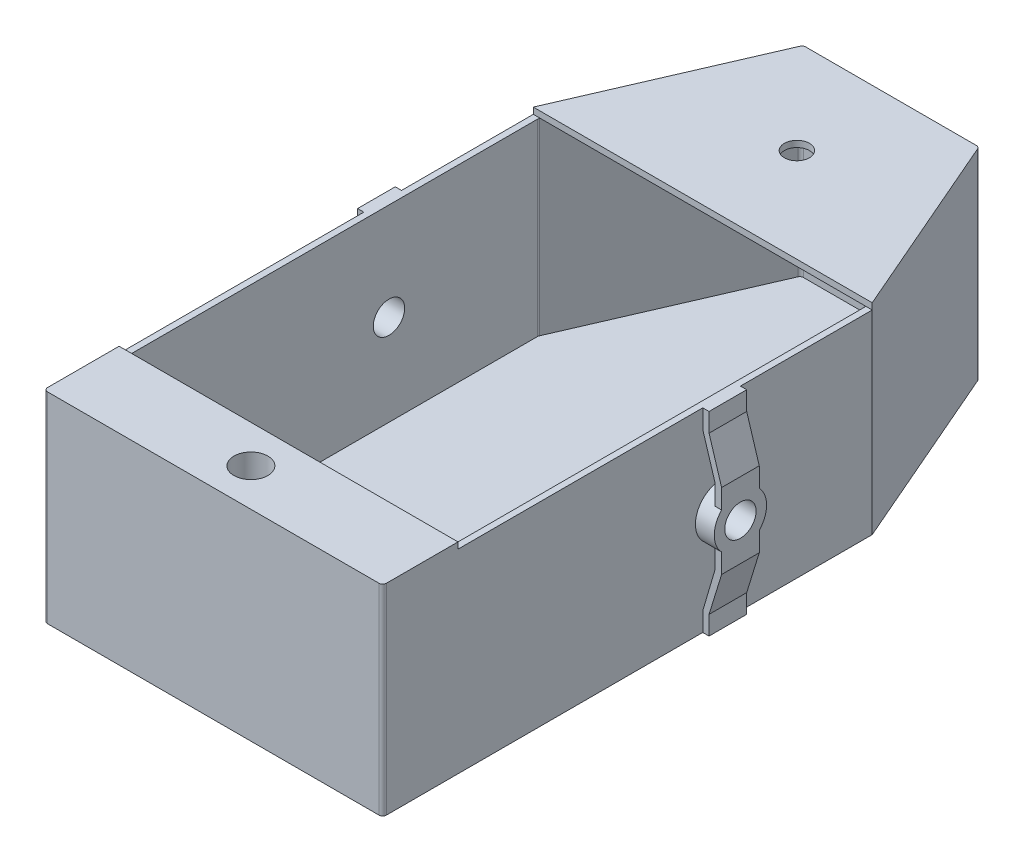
ISO-10303-21;
HEADER;
FILE_DESCRIPTION(('STEP AP214'),'2;1');
FILE_NAME('part.step','',(''),(''),'','','');
FILE_SCHEMA(('AUTOMOTIVE_DESIGN { 1 0 10303 214 1 1 1 1 }'));
ENDSEC;
DATA;
#1=APPLICATION_CONTEXT('core data for automotive mechanical design processes');
#2=APPLICATION_PROTOCOL_DEFINITION('international standard','automotive_design',2000,#1);
#3=PRODUCT_CONTEXT('',#1,'mechanical');
#4=PRODUCT('Part','Part','',(#3));
#5=PRODUCT_RELATED_PRODUCT_CATEGORY('part','',(#4));
#6=PRODUCT_DEFINITION_FORMATION('','',#4);
#7=PRODUCT_DEFINITION_CONTEXT('part definition',#1,'design');
#8=PRODUCT_DEFINITION('design','',#6,#7);
#9=PRODUCT_DEFINITION_SHAPE('','',#8);
#10=(LENGTH_UNIT() NAMED_UNIT(*) SI_UNIT(.MILLI.,.METRE.));
#11=(NAMED_UNIT(*) PLANE_ANGLE_UNIT() SI_UNIT($,.RADIAN.));
#12=(NAMED_UNIT(*) SI_UNIT($,.STERADIAN.) SOLID_ANGLE_UNIT());
#13=UNCERTAINTY_MEASURE_WITH_UNIT(LENGTH_MEASURE(1.E-05),#10,'distance_accuracy_value','');
#14=(GEOMETRIC_REPRESENTATION_CONTEXT(3) GLOBAL_UNCERTAINTY_ASSIGNED_CONTEXT((#13)) GLOBAL_UNIT_ASSIGNED_CONTEXT((#10,
#11,#12)) REPRESENTATION_CONTEXT('',''));
#15=CARTESIAN_POINT('',(0.,0.,0.));
#16=DIRECTION('',(0.,0.,1.));
#17=DIRECTION('',(1.,0.,0.));
#18=AXIS2_PLACEMENT_3D('',#15,#16,#17);
#19=CARTESIAN_POINT('',(0.,155.,0.));
#20=DIRECTION('',(0.,1.,0.));
#21=DIRECTION('',(0.,0.,1.));
#22=AXIS2_PLACEMENT_3D('',#19,#20,#21);
#23=PLANE('',#22);
#24=DIRECTION('',(0.,0.,1.));
#25=VECTOR('',#24,1.);
#26=CARTESIAN_POINT('',(-135.,155.,-120.));
#27=LINE('',#26,#25);
#28=CARTESIAN_POINT('',(-135.,155.,15.));
#29=VERTEX_POINT('',#28);
#30=CARTESIAN_POINT('',(-135.,155.,210.));
#31=VERTEX_POINT('',#30);
#32=EDGE_CURVE('E907',#29,#31,#27,.T.);
#33=ORIENTED_EDGE('',*,*,#32,.T.);
#34=DIRECTION('',(-1.,0.,0.));
#35=VECTOR('',#34,1.);
#36=CARTESIAN_POINT('',(-135.,155.,210.));
#37=LINE('',#36,#35);
#38=CARTESIAN_POINT('',(-130.,155.,210.));
#39=VERTEX_POINT('',#38);
#40=EDGE_CURVE('E484',#39,#31,#37,.T.);
#41=ORIENTED_EDGE('',*,*,#40,.F.);
#42=DIRECTION('',(0.,0.,1.));
#43=VECTOR('',#42,1.);
#44=CARTESIAN_POINT('',(-130.,155.,-118.963244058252));
#45=LINE('',#44,#43);
#46=CARTESIAN_POINT('',(-130.,155.,-118.341190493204));
#47=VERTEX_POINT('',#46);
#48=EDGE_CURVE('E896',#47,#39,#45,.T.);
#49=ORIENTED_EDGE('',*,*,#48,.F.);
#50=CARTESIAN_POINT('',(-127.,155.,-118.341190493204));
#51=DIRECTION('',(0.,1.,0.));
#52=DIRECTION('',(0.,0.,1.));
#53=AXIS2_PLACEMENT_3D('',#50,#51,#52);
#54=CIRCLE('',#53,3.);
#55=CARTESIAN_POINT('',(-129.75266687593,155.,-119.534012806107));
#56=VERTEX_POINT('',#55);
#57=EDGE_CURVE('E11',#47,#56,#54,.F.);
#58=ORIENTED_EDGE('',*,*,#57,.T.);
#59=DIRECTION('',(-0.397607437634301,0.,0.917555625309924));
#60=VECTOR('',#59,1.);
#61=CARTESIAN_POINT('',(-66.7174057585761,155.,-265.));
#62=LINE('',#61,#60);
#63=CARTESIAN_POINT('',(-129.550739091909,155.,-120.));
#64=VERTEX_POINT('',#63);
#65=EDGE_CURVE('E892',#64,#56,#62,.T.);
#66=ORIENTED_EDGE('',*,*,#65,.F.);
#67=DIRECTION('',(1.,0.,0.));
#68=VECTOR('',#67,1.);
#69=CARTESIAN_POINT('',(-135.,155.,-120.));
#70=LINE('',#69,#68);
#71=CARTESIAN_POINT('',(-135.,155.,-120.));
#72=VERTEX_POINT('',#71);
#73=EDGE_CURVE('E860',#72,#64,#70,.T.);
#74=ORIENTED_EDGE('',*,*,#73,.F.);
#75=CARTESIAN_POINT('',(-135.,155.,-15.));
#76=VERTEX_POINT('',#75);
#77=EDGE_CURVE('E931',#72,#76,#27,.T.);
#78=ORIENTED_EDGE('',*,*,#77,.T.);
#79=DIRECTION('',(1.,0.,0.));
#80=VECTOR('',#79,1.);
#81=CARTESIAN_POINT('',(-140.,155.,-15.));
#82=LINE('',#81,#80);
#83=CARTESIAN_POINT('',(-140.,155.,-15.));
#84=VERTEX_POINT('',#83);
#85=EDGE_CURVE('E653',#84,#76,#82,.T.);
#86=ORIENTED_EDGE('',*,*,#85,.F.);
#87=DIRECTION('',(0.,0.,1.));
#88=VECTOR('',#87,1.);
#89=CARTESIAN_POINT('',(-140.,155.,0.));
#90=LINE('',#89,#88);
#91=CARTESIAN_POINT('',(-140.,155.,15.));
#92=VERTEX_POINT('',#91);
#93=EDGE_CURVE('E624',#84,#92,#90,.T.);
#94=ORIENTED_EDGE('',*,*,#93,.T.);
#95=DIRECTION('',(1.,0.,0.));
#96=VECTOR('',#95,1.);
#97=CARTESIAN_POINT('',(-140.,155.,15.));
#98=LINE('',#97,#96);
#99=EDGE_CURVE('E640',#92,#29,#98,.T.);
#100=ORIENTED_EDGE('',*,*,#99,.T.);
#101=EDGE_LOOP('',(#33,#41,#49,#58,#66,#74,#78,#86,#94,#100));
#102=FACE_BOUND('',#101,.T.);
#103=ADVANCED_FACE('F43',(#102),#23,.T.);
#104=DIRECTION('',(0.,0.,-1.));
#105=VECTOR('',#104,1.);
#106=CARTESIAN_POINT('',(130.,155.,265.));
#107=LINE('',#106,#105);
#108=CARTESIAN_POINT('',(130.,155.,210.));
#109=VERTEX_POINT('',#108);
#110=CARTESIAN_POINT('',(130.,155.,-118.341190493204));
#111=VERTEX_POINT('',#110);
#112=EDGE_CURVE('E903',#109,#111,#107,.T.);
#113=ORIENTED_EDGE('',*,*,#112,.F.);
#114=CARTESIAN_POINT('',(135.,155.,210.));
#115=VERTEX_POINT('',#114);
#116=EDGE_CURVE('E496',#115,#109,#37,.T.);
#117=ORIENTED_EDGE('',*,*,#116,.F.);
#118=DIRECTION('',(0.,0.,-1.));
#119=VECTOR('',#118,1.);
#120=CARTESIAN_POINT('',(135.,155.,270.));
#121=LINE('',#120,#119);
#122=CARTESIAN_POINT('',(135.,155.,15.));
#123=VERTEX_POINT('',#122);
#124=EDGE_CURVE('E936',#115,#123,#121,.T.);
#125=ORIENTED_EDGE('',*,*,#124,.T.);
#126=DIRECTION('',(-1.,0.,0.));
#127=VECTOR('',#126,1.);
#128=CARTESIAN_POINT('',(140.,155.,15.));
#129=LINE('',#128,#127);
#130=CARTESIAN_POINT('',(140.,155.,15.));
#131=VERTEX_POINT('',#130);
#132=EDGE_CURVE('E772',#131,#123,#129,.T.);
#133=ORIENTED_EDGE('',*,*,#132,.F.);
#134=DIRECTION('',(0.,0.,1.));
#135=VECTOR('',#134,1.);
#136=CARTESIAN_POINT('',(140.,155.,0.));
#137=LINE('',#136,#135);
#138=CARTESIAN_POINT('',(140.,155.,-15.));
#139=VERTEX_POINT('',#138);
#140=EDGE_CURVE('E794',#139,#131,#137,.T.);
#141=ORIENTED_EDGE('',*,*,#140,.F.);
#142=DIRECTION('',(-1.,0.,0.));
#143=VECTOR('',#142,1.);
#144=CARTESIAN_POINT('',(140.,155.,-15.));
#145=LINE('',#144,#143);
#146=CARTESIAN_POINT('',(135.,155.,-15.));
#147=VERTEX_POINT('',#146);
#148=EDGE_CURVE('E785',#139,#147,#145,.T.);
#149=ORIENTED_EDGE('',*,*,#148,.T.);
#150=CARTESIAN_POINT('',(135.,155.,-120.));
#151=VERTEX_POINT('',#150);
#152=EDGE_CURVE('E935',#147,#151,#121,.T.);
#153=ORIENTED_EDGE('',*,*,#152,.T.);
#154=CARTESIAN_POINT('',(129.550739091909,155.,-120.));
#155=VERTEX_POINT('',#154);
#156=EDGE_CURVE('E875',#155,#151,#70,.T.);
#157=ORIENTED_EDGE('',*,*,#156,.F.);
#158=DIRECTION('',(-0.3976074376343,0.,-0.917555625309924));
#159=VECTOR('',#158,1.);
#160=CARTESIAN_POINT('',(130.,155.,-118.963244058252));
#161=LINE('',#160,#159);
#162=CARTESIAN_POINT('',(129.75266687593,155.,-119.534012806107));
#163=VERTEX_POINT('',#162);
#164=EDGE_CURVE('E884',#163,#155,#161,.T.);
#165=ORIENTED_EDGE('',*,*,#164,.F.);
#166=CARTESIAN_POINT('',(127.,155.,-118.341190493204));
#167=DIRECTION('',(0.,1.,0.));
#168=DIRECTION('',(0.,0.,1.));
#169=AXIS2_PLACEMENT_3D('',#166,#167,#168);
#170=CIRCLE('',#169,3.);
#171=EDGE_CURVE('E52',#163,#111,#170,.F.);
#172=ORIENTED_EDGE('',*,*,#171,.T.);
#173=EDGE_LOOP('',(#113,#117,#125,#133,#141,#149,#153,#157,#165,#172));
#174=FACE_BOUND('',#173,.T.);
#175=ADVANCED_FACE('F1114',(#174),#23,.T.);
#176=CARTESIAN_POINT('',(-140.,15.,15.));
#177=DIRECTION('',(0.,0.,1.));
#178=DIRECTION('',(0.,-1.,0.));
#179=AXIS2_PLACEMENT_3D('',#176,#177,#178);
#180=PLANE('',#179);
#181=DIRECTION('',(0.,1.,0.));
#182=VECTOR('',#181,1.);
#183=CARTESIAN_POINT('',(-150.,47.5,14.9999999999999));
#184=LINE('',#183,#182);
#185=CARTESIAN_POINT('',(-150.,91.9740217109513,14.9999999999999));
#186=VERTEX_POINT('',#185);
#187=CARTESIAN_POINT('',(-150.,107.5,14.9999999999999));
#188=VERTEX_POINT('',#187);
#189=EDGE_CURVE('E601',#186,#188,#184,.T.);
#190=ORIENTED_EDGE('',*,*,#189,.F.);
#191=DIRECTION('',(-1.,0.,0.));
#192=VECTOR('',#191,1.);
#193=CARTESIAN_POINT('',(150.002,91.9740217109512,15.));
#194=LINE('',#193,#192);
#195=CARTESIAN_POINT('',(-144.567567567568,91.9740217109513,14.9999999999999));
#196=VERTEX_POINT('',#195);
#197=EDGE_CURVE('E550',#196,#186,#194,.T.);
#198=ORIENTED_EDGE('',*,*,#197,.F.);
#199=DIRECTION('',(0.,-1.,0.));
#200=VECTOR('',#199,1.);
#201=CARTESIAN_POINT('',(-144.567567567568,108.905405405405,14.9999999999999));
#202=LINE('',#201,#200);
#203=CARTESIAN_POINT('',(-144.567567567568,108.905405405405,14.9999999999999));
#204=VERTEX_POINT('',#203);
#205=EDGE_CURVE('E591',#204,#196,#202,.T.);
#206=ORIENTED_EDGE('',*,*,#205,.F.);
#207=DIRECTION('',(-0.294085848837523,-0.95577900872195,0.));
#208=VECTOR('',#207,1.);
#209=CARTESIAN_POINT('',(-135.,140.,14.9999999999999));
#210=LINE('',#209,#208);
#211=CARTESIAN_POINT('',(-135.,140.,15.));
#212=VERTEX_POINT('',#211);
#213=EDGE_CURVE('E594',#212,#204,#210,.T.);
#214=ORIENTED_EDGE('',*,*,#213,.F.);
#215=DIRECTION('',(0.,-1.,0.));
#216=VECTOR('',#215,1.);
#217=CARTESIAN_POINT('',(-135.,140.,15.));
#218=LINE('',#217,#216);
#219=EDGE_CURVE('E628',#29,#212,#218,.T.);
#220=ORIENTED_EDGE('',*,*,#219,.F.);
#221=ORIENTED_EDGE('',*,*,#99,.F.);
#222=DIRECTION('',(0.,-1.,0.));
#223=VECTOR('',#222,1.);
#224=CARTESIAN_POINT('',(-140.,140.,15.));
#225=LINE('',#224,#223);
#226=CARTESIAN_POINT('',(-140.,140.,15.));
#227=VERTEX_POINT('',#226);
#228=EDGE_CURVE('E636',#92,#227,#225,.T.);
#229=ORIENTED_EDGE('',*,*,#228,.T.);
#230=DIRECTION('',(0.294085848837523,0.95577900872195,0.));
#231=VECTOR('',#230,1.);
#232=CARTESIAN_POINT('',(-150.,107.5,14.9999999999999));
#233=LINE('',#232,#231);
#234=EDGE_CURVE('E597',#188,#227,#233,.T.);
#235=ORIENTED_EDGE('',*,*,#234,.F.);
#236=EDGE_LOOP('',(#190,#198,#206,#214,#220,#221,#229,#235));
#237=FACE_BOUND('',#236,.T.);
#238=ADVANCED_FACE('F1250',(#237),#180,.T.);
#239=CARTESIAN_POINT('',(-144.567567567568,63.0259782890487,14.9999999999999));
#240=VERTEX_POINT('',#239);
#241=CARTESIAN_POINT('',(-144.567567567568,47.5,14.9999999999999));
#242=VERTEX_POINT('',#241);
#243=EDGE_CURVE('E590',#240,#242,#202,.T.);
#244=ORIENTED_EDGE('',*,*,#243,.F.);
#245=DIRECTION('',(-1.,0.,0.));
#246=VECTOR('',#245,1.);
#247=CARTESIAN_POINT('',(150.002,63.0259782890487,15.));
#248=LINE('',#247,#246);
#249=CARTESIAN_POINT('',(-150.,63.0259782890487,14.9999999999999));
#250=VERTEX_POINT('',#249);
#251=EDGE_CURVE('E555',#250,#240,#248,.F.);
#252=ORIENTED_EDGE('',*,*,#251,.F.);
#253=CARTESIAN_POINT('',(-150.,47.5,14.9999999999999));
#254=VERTEX_POINT('',#253);
#255=EDGE_CURVE('E602',#254,#250,#184,.T.);
#256=ORIENTED_EDGE('',*,*,#255,.F.);
#257=DIRECTION('',(-0.294085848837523,0.95577900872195,0.));
#258=VECTOR('',#257,1.);
#259=CARTESIAN_POINT('',(-150.,47.5,14.9999999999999));
#260=LINE('',#259,#258);
#261=CARTESIAN_POINT('',(-140.,15.,14.9999999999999));
#262=VERTEX_POINT('',#261);
#263=EDGE_CURVE('E567',#262,#254,#260,.T.);
#264=ORIENTED_EDGE('',*,*,#263,.F.);
#265=DIRECTION('',(0.,-1.,0.));
#266=VECTOR('',#265,1.);
#267=CARTESIAN_POINT('',(-140.,15.,15.));
#268=LINE('',#267,#266);
#269=CARTESIAN_POINT('',(-140.,0.,15.));
#270=VERTEX_POINT('',#269);
#271=EDGE_CURVE('E660',#262,#270,#268,.T.);
#272=ORIENTED_EDGE('',*,*,#271,.T.);
#273=DIRECTION('',(1.,0.,0.));
#274=VECTOR('',#273,1.);
#275=CARTESIAN_POINT('',(-140.,0.,15.));
#276=LINE('',#275,#274);
#277=CARTESIAN_POINT('',(-135.,0.,15.));
#278=VERTEX_POINT('',#277);
#279=EDGE_CURVE('E685',#270,#278,#276,.T.);
#280=ORIENTED_EDGE('',*,*,#279,.T.);
#281=DIRECTION('',(0.,-1.,0.));
#282=VECTOR('',#281,1.);
#283=CARTESIAN_POINT('',(-135.,15.,15.));
#284=LINE('',#283,#282);
#285=CARTESIAN_POINT('',(-135.,15.,15.));
#286=VERTEX_POINT('',#285);
#287=EDGE_CURVE('E656',#286,#278,#284,.T.);
#288=ORIENTED_EDGE('',*,*,#287,.F.);
#289=DIRECTION('',(0.282403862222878,-0.959295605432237,0.));
#290=VECTOR('',#289,1.);
#291=CARTESIAN_POINT('',(-144.567567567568,47.5,14.9999999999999));
#292=LINE('',#291,#290);
#293=EDGE_CURVE('E544',#242,#286,#292,.T.);
#294=ORIENTED_EDGE('',*,*,#293,.F.);
#295=EDGE_LOOP('',(#244,#252,#256,#264,#272,#280,#288,#294));
#296=FACE_BOUND('',#295,.T.);
#297=ADVANCED_FACE('F1223',(#296),#180,.T.);
#298=CARTESIAN_POINT('',(-140.,0.,-15.));
#299=DIRECTION('',(0.,0.,-1.));
#300=DIRECTION('',(-1.,0.,0.));
#301=AXIS2_PLACEMENT_3D('',#298,#299,#300);
#302=PLANE('',#301);
#303=DIRECTION('',(0.,1.,0.));
#304=VECTOR('',#303,1.);
#305=CARTESIAN_POINT('',(-150.,47.5,-15.0000000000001));
#306=LINE('',#305,#304);
#307=CARTESIAN_POINT('',(-150.,47.5,-15.0000000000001));
#308=VERTEX_POINT('',#307);
#309=CARTESIAN_POINT('',(-150.,63.0259782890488,-15.0000000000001));
#310=VERTEX_POINT('',#309);
#311=EDGE_CURVE('E580',#308,#310,#306,.T.);
#312=ORIENTED_EDGE('',*,*,#311,.T.);
#313=DIRECTION('',(-1.,0.,0.));
#314=VECTOR('',#313,1.);
#315=CARTESIAN_POINT('',(150.002,63.0259782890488,-15.));
#316=LINE('',#315,#314);
#317=CARTESIAN_POINT('',(-144.567567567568,63.0259782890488,-15.0000000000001));
#318=VERTEX_POINT('',#317);
#319=EDGE_CURVE('E551',#318,#310,#316,.T.);
#320=ORIENTED_EDGE('',*,*,#319,.F.);
#321=DIRECTION('',(0.,-1.,0.));
#322=VECTOR('',#321,1.);
#323=CARTESIAN_POINT('',(-144.567567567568,108.905405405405,-15.0000000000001));
#324=LINE('',#323,#322);
#325=CARTESIAN_POINT('',(-144.567567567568,47.5,-15.0000000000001));
#326=VERTEX_POINT('',#325);
#327=EDGE_CURVE('E566',#318,#326,#324,.T.);
#328=ORIENTED_EDGE('',*,*,#327,.T.);
#329=DIRECTION('',(0.282403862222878,-0.959295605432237,0.));
#330=VECTOR('',#329,1.);
#331=CARTESIAN_POINT('',(-144.567567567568,47.5,-15.0000000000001));
#332=LINE('',#331,#330);
#333=CARTESIAN_POINT('',(-135.,15.,-15.));
#334=VERTEX_POINT('',#333);
#335=EDGE_CURVE('E562',#326,#334,#332,.T.);
#336=ORIENTED_EDGE('',*,*,#335,.T.);
#337=DIRECTION('',(0.,1.,0.));
#338=VECTOR('',#337,1.);
#339=CARTESIAN_POINT('',(-135.,0.,-15.));
#340=LINE('',#339,#338);
#341=CARTESIAN_POINT('',(-135.,0.,-15.));
#342=VERTEX_POINT('',#341);
#343=EDGE_CURVE('E661',#342,#334,#340,.T.);
#344=ORIENTED_EDGE('',*,*,#343,.F.);
#345=DIRECTION('',(1.,0.,0.));
#346=VECTOR('',#345,1.);
#347=CARTESIAN_POINT('',(-140.,0.,-15.));
#348=LINE('',#347,#346);
#349=CARTESIAN_POINT('',(-140.,0.,-15.));
#350=VERTEX_POINT('',#349);
#351=EDGE_CURVE('E673',#350,#342,#348,.T.);
#352=ORIENTED_EDGE('',*,*,#351,.F.);
#353=DIRECTION('',(0.,1.,0.));
#354=VECTOR('',#353,1.);
#355=CARTESIAN_POINT('',(-140.,0.,-15.));
#356=LINE('',#355,#354);
#357=CARTESIAN_POINT('',(-140.,15.,-15.));
#358=VERTEX_POINT('',#357);
#359=EDGE_CURVE('E669',#350,#358,#356,.T.);
#360=ORIENTED_EDGE('',*,*,#359,.T.);
#361=DIRECTION('',(-0.294085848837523,0.95577900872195,0.));
#362=VECTOR('',#361,1.);
#363=CARTESIAN_POINT('',(-150.,47.5,-15.0000000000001));
#364=LINE('',#363,#362);
#365=EDGE_CURVE('E583',#358,#308,#364,.T.);
#366=ORIENTED_EDGE('',*,*,#365,.T.);
#367=EDGE_LOOP('',(#312,#320,#328,#336,#344,#352,#360,#366));
#368=FACE_BOUND('',#367,.T.);
#369=ADVANCED_FACE('F1236',(#368),#302,.T.);
#370=CARTESIAN_POINT('',(-144.567567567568,108.905405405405,-15.0000000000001));
#371=VERTEX_POINT('',#370);
#372=CARTESIAN_POINT('',(-144.567567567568,91.9740217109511,-15.0000000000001));
#373=VERTEX_POINT('',#372);
#374=EDGE_CURVE('E568',#371,#373,#324,.T.);
#375=ORIENTED_EDGE('',*,*,#374,.T.);
#376=DIRECTION('',(-1.,0.,0.));
#377=VECTOR('',#376,1.);
#378=CARTESIAN_POINT('',(150.002,91.9740217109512,-15.));
#379=LINE('',#378,#377);
#380=CARTESIAN_POINT('',(-150.,91.9740217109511,-15.0000000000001));
#381=VERTEX_POINT('',#380);
#382=EDGE_CURVE('E546',#381,#373,#379,.F.);
#383=ORIENTED_EDGE('',*,*,#382,.F.);
#384=CARTESIAN_POINT('',(-150.,107.5,-15.0000000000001));
#385=VERTEX_POINT('',#384);
#386=EDGE_CURVE('E579',#381,#385,#306,.T.);
#387=ORIENTED_EDGE('',*,*,#386,.T.);
#388=DIRECTION('',(0.294085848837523,0.95577900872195,0.));
#389=VECTOR('',#388,1.);
#390=CARTESIAN_POINT('',(-150.,107.5,-15.0000000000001));
#391=LINE('',#390,#389);
#392=CARTESIAN_POINT('',(-140.,140.,-15.0000000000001));
#393=VERTEX_POINT('',#392);
#394=EDGE_CURVE('E575',#385,#393,#391,.T.);
#395=ORIENTED_EDGE('',*,*,#394,.T.);
#396=DIRECTION('',(0.,1.,0.));
#397=VECTOR('',#396,1.);
#398=CARTESIAN_POINT('',(-140.,155.,-15.));
#399=LINE('',#398,#397);
#400=EDGE_CURVE('E627',#393,#84,#399,.T.);
#401=ORIENTED_EDGE('',*,*,#400,.T.);
#402=ORIENTED_EDGE('',*,*,#85,.T.);
#403=DIRECTION('',(0.,1.,0.));
#404=VECTOR('',#403,1.);
#405=CARTESIAN_POINT('',(-135.,155.,-15.));
#406=LINE('',#405,#404);
#407=CARTESIAN_POINT('',(-135.,140.,-15.));
#408=VERTEX_POINT('',#407);
#409=EDGE_CURVE('E612',#408,#76,#406,.T.);
#410=ORIENTED_EDGE('',*,*,#409,.F.);
#411=DIRECTION('',(-0.294085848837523,-0.95577900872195,0.));
#412=VECTOR('',#411,1.);
#413=CARTESIAN_POINT('',(-135.,140.,-15.0000000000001));
#414=LINE('',#413,#412);
#415=EDGE_CURVE('E572',#408,#371,#414,.T.);
#416=ORIENTED_EDGE('',*,*,#415,.T.);
#417=EDGE_LOOP('',(#375,#383,#387,#395,#401,#402,#410,#416));
#418=FACE_BOUND('',#417,.T.);
#419=ADVANCED_FACE('F1242',(#418),#302,.T.);
#420=CARTESIAN_POINT('',(-144.567567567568,108.905405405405,-15.0000000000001));
#421=DIRECTION('',(-1.,0.,0.));
#422=DIRECTION('',(0.,0.,1.));
#423=AXIS2_PLACEMENT_3D('',#420,#421,#422);
#424=PLANE('',#423);
#425=CARTESIAN_POINT('',(-144.567567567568,77.5,0.));
#426=DIRECTION('',(-1.,0.,0.));
#427=DIRECTION('',(0.,0.,1.));
#428=AXIS2_PLACEMENT_3D('',#425,#426,#427);
#429=CIRCLE('',#428,20.8445989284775);
#430=EDGE_CURVE('E545',#318,#240,#429,.T.);
#431=ORIENTED_EDGE('',*,*,#430,.T.);
#432=ORIENTED_EDGE('',*,*,#243,.T.);
#433=DIRECTION('',(0.,0.,1.));
#434=VECTOR('',#433,1.);
#435=CARTESIAN_POINT('',(-144.567567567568,47.5,-15.0000000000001));
#436=LINE('',#435,#434);
#437=EDGE_CURVE('E586',#326,#242,#436,.T.);
#438=ORIENTED_EDGE('',*,*,#437,.F.);
#439=ORIENTED_EDGE('',*,*,#327,.F.);
#440=EDGE_LOOP('',(#431,#432,#438,#439));
#441=FACE_BOUND('',#440,.T.);
#442=ADVANCED_FACE('F1228',(#441),#424,.F.);
#443=CARTESIAN_POINT('',(140.,0.,-15.));
#444=DIRECTION('',(0.,0.,1.));
#445=DIRECTION('',(1.,0.,0.));
#446=AXIS2_PLACEMENT_3D('',#443,#444,#445);
#447=PLANE('',#446);
#448=DIRECTION('',(0.,-1.,0.));
#449=VECTOR('',#448,1.);
#450=CARTESIAN_POINT('',(144.567567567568,108.905405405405,-15.0000000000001));
#451=LINE('',#450,#449);
#452=CARTESIAN_POINT('',(144.567567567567,63.0259782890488,-15.0000000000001));
#453=VERTEX_POINT('',#452);
#454=CARTESIAN_POINT('',(144.567567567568,47.5,-15.0000000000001));
#455=VERTEX_POINT('',#454);
#456=EDGE_CURVE('E736',#453,#455,#451,.T.);
#457=ORIENTED_EDGE('',*,*,#456,.F.);
#458=DIRECTION('',(1.,0.,0.));
#459=VECTOR('',#458,1.);
#460=CARTESIAN_POINT('',(-135.002,63.0259782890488,-15.));
#461=LINE('',#460,#459);
#462=CARTESIAN_POINT('',(150.,63.0259782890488,-15.0000000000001));
#463=VERTEX_POINT('',#462);
#464=EDGE_CURVE('E707',#463,#453,#461,.F.);
#465=ORIENTED_EDGE('',*,*,#464,.F.);
#466=DIRECTION('',(0.,1.,0.));
#467=VECTOR('',#466,1.);
#468=CARTESIAN_POINT('',(150.,47.5,-15.0000000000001));
#469=LINE('',#468,#467);
#470=CARTESIAN_POINT('',(150.,47.5,-15.0000000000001));
#471=VERTEX_POINT('',#470);
#472=EDGE_CURVE('E725',#471,#463,#469,.T.);
#473=ORIENTED_EDGE('',*,*,#472,.F.);
#474=DIRECTION('',(0.294085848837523,0.95577900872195,0.));
#475=VECTOR('',#474,1.);
#476=CARTESIAN_POINT('',(150.,47.5,-15.0000000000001));
#477=LINE('',#476,#475);
#478=CARTESIAN_POINT('',(140.,15.,-15.0000000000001));
#479=VERTEX_POINT('',#478);
#480=EDGE_CURVE('E719',#479,#471,#477,.T.);
#481=ORIENTED_EDGE('',*,*,#480,.F.);
#482=DIRECTION('',(0.,1.,0.));
#483=VECTOR('',#482,1.);
#484=CARTESIAN_POINT('',(140.,0.,-15.));
#485=LINE('',#484,#483);
#486=CARTESIAN_POINT('',(140.,0.,-15.));
#487=VERTEX_POINT('',#486);
#488=EDGE_CURVE('E817',#487,#479,#485,.T.);
#489=ORIENTED_EDGE('',*,*,#488,.F.);
#490=DIRECTION('',(-1.,0.,0.));
#491=VECTOR('',#490,1.);
#492=CARTESIAN_POINT('',(140.,0.,-15.));
#493=LINE('',#492,#491);
#494=CARTESIAN_POINT('',(135.,0.,-15.));
#495=VERTEX_POINT('',#494);
#496=EDGE_CURVE('E842',#487,#495,#493,.T.);
#497=ORIENTED_EDGE('',*,*,#496,.T.);
#498=DIRECTION('',(0.,1.,0.));
#499=VECTOR('',#498,1.);
#500=CARTESIAN_POINT('',(135.,0.,-15.));
#501=LINE('',#500,#499);
#502=CARTESIAN_POINT('',(135.,15.,-15.0000000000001));
#503=VERTEX_POINT('',#502);
#504=EDGE_CURVE('E801',#495,#503,#501,.T.);
#505=ORIENTED_EDGE('',*,*,#504,.T.);
#506=DIRECTION('',(-0.282403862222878,-0.959295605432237,0.));
#507=VECTOR('',#506,1.);
#508=CARTESIAN_POINT('',(144.567567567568,47.5,-15.0000000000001));
#509=LINE('',#508,#507);
#510=EDGE_CURVE('E741',#455,#503,#509,.T.);
#511=ORIENTED_EDGE('',*,*,#510,.F.);
#512=EDGE_LOOP('',(#457,#465,#473,#481,#489,#497,#505,#511));
#513=FACE_BOUND('',#512,.T.);
#514=ADVANCED_FACE('F1784',(#513),#447,.F.);
#515=CARTESIAN_POINT('',(140.,15.,15.));
#516=DIRECTION('',(0.,0.,-1.));
#517=DIRECTION('',(0.,1.,0.));
#518=AXIS2_PLACEMENT_3D('',#515,#516,#517);
#519=PLANE('',#518);
#520=DIRECTION('',(0.,-1.,0.));
#521=VECTOR('',#520,1.);
#522=CARTESIAN_POINT('',(144.567567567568,108.905405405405,14.9999999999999));
#523=LINE('',#522,#521);
#524=CARTESIAN_POINT('',(144.567567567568,108.905405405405,14.9999999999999));
#525=VERTEX_POINT('',#524);
#526=CARTESIAN_POINT('',(144.567567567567,91.9740217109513,14.9999999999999));
#527=VERTEX_POINT('',#526);
#528=EDGE_CURVE('E761',#525,#527,#523,.T.);
#529=ORIENTED_EDGE('',*,*,#528,.T.);
#530=DIRECTION('',(1.,0.,0.));
#531=VECTOR('',#530,1.);
#532=CARTESIAN_POINT('',(-135.002,91.9740217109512,15.));
#533=LINE('',#532,#531);
#534=CARTESIAN_POINT('',(150.,91.9740217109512,15.));
#535=VERTEX_POINT('',#534);
#536=EDGE_CURVE('E708',#535,#527,#533,.F.);
#537=ORIENTED_EDGE('',*,*,#536,.F.);
#538=DIRECTION('',(0.,1.,0.));
#539=VECTOR('',#538,1.);
#540=CARTESIAN_POINT('',(150.,47.5,14.9999999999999));
#541=LINE('',#540,#539);
#542=CARTESIAN_POINT('',(150.,107.5,14.9999999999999));
#543=VERTEX_POINT('',#542);
#544=EDGE_CURVE('E748',#535,#543,#541,.T.);
#545=ORIENTED_EDGE('',*,*,#544,.T.);
#546=DIRECTION('',(-0.294085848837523,0.95577900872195,0.));
#547=VECTOR('',#546,1.);
#548=CARTESIAN_POINT('',(150.,107.5,14.9999999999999));
#549=LINE('',#548,#547);
#550=CARTESIAN_POINT('',(140.,140.,14.9999999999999));
#551=VERTEX_POINT('',#550);
#552=EDGE_CURVE('E752',#543,#551,#549,.T.);
#553=ORIENTED_EDGE('',*,*,#552,.T.);
#554=DIRECTION('',(0.,-1.,0.));
#555=VECTOR('',#554,1.);
#556=CARTESIAN_POINT('',(140.,140.,15.));
#557=LINE('',#556,#555);
#558=EDGE_CURVE('E808',#131,#551,#557,.T.);
#559=ORIENTED_EDGE('',*,*,#558,.F.);
#560=ORIENTED_EDGE('',*,*,#132,.T.);
#561=DIRECTION('',(0.,-1.,0.));
#562=VECTOR('',#561,1.);
#563=CARTESIAN_POINT('',(135.,140.,15.));
#564=LINE('',#563,#562);
#565=CARTESIAN_POINT('',(135.,140.,14.9999999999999));
#566=VERTEX_POINT('',#565);
#567=EDGE_CURVE('E797',#123,#566,#564,.T.);
#568=ORIENTED_EDGE('',*,*,#567,.T.);
#569=DIRECTION('',(0.294085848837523,-0.95577900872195,0.));
#570=VECTOR('',#569,1.);
#571=CARTESIAN_POINT('',(135.,140.,14.9999999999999));
#572=LINE('',#571,#570);
#573=EDGE_CURVE('E756',#566,#525,#572,.T.);
#574=ORIENTED_EDGE('',*,*,#573,.T.);
#575=EDGE_LOOP('',(#529,#537,#545,#553,#559,#560,#568,#574));
#576=FACE_BOUND('',#575,.T.);
#577=ADVANCED_FACE('F1851',(#576),#519,.F.);
#578=CARTESIAN_POINT('',(144.567567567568,108.905405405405,-15.0000000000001));
#579=DIRECTION('',(-1.,0.,0.));
#580=DIRECTION('',(0.,0.,1.));
#581=AXIS2_PLACEMENT_3D('',#578,#579,#580);
#582=PLANE('',#581);
#583=CARTESIAN_POINT('',(144.567567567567,77.5,0.));
#584=DIRECTION('',(-1.,0.,0.));
#585=DIRECTION('',(0.,0.,1.));
#586=AXIS2_PLACEMENT_3D('',#583,#584,#585);
#587=CIRCLE('',#586,20.8445989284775);
#588=CARTESIAN_POINT('',(144.567567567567,91.9740217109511,-15.0000000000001));
#589=VERTEX_POINT('',#588);
#590=EDGE_CURVE('E703',#589,#527,#587,.F.);
#591=ORIENTED_EDGE('',*,*,#590,.T.);
#592=ORIENTED_EDGE('',*,*,#528,.F.);
#593=DIRECTION('',(0.,0.,1.));
#594=VECTOR('',#593,1.);
#595=CARTESIAN_POINT('',(144.567567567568,108.905405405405,-15.0000000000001));
#596=LINE('',#595,#594);
#597=CARTESIAN_POINT('',(144.567567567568,108.905405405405,-15.0000000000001));
#598=VERTEX_POINT('',#597);
#599=EDGE_CURVE('E773',#598,#525,#596,.T.);
#600=ORIENTED_EDGE('',*,*,#599,.F.);
#601=EDGE_CURVE('E737',#598,#589,#451,.T.);
#602=ORIENTED_EDGE('',*,*,#601,.T.);
#603=EDGE_LOOP('',(#591,#592,#600,#602));
#604=FACE_BOUND('',#603,.T.);
#605=ADVANCED_FACE('F1324',(#604),#582,.T.);
#606=CARTESIAN_POINT('',(135.,5.,270.));
#607=DIRECTION('',(-1.,0.,0.));
#608=DIRECTION('',(0.,0.,1.));
#609=AXIS2_PLACEMENT_3D('',#606,#607,#608);
#610=PLANE('',#609);
#611=CARTESIAN_POINT('',(135.,77.5,0.));
#612=DIRECTION('',(-1.,0.,0.));
#613=DIRECTION('',(0.,0.,1.));
#614=AXIS2_PLACEMENT_3D('',#611,#612,#613);
#615=CIRCLE('',#614,20.8445989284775);
#616=CARTESIAN_POINT('',(135.,77.5,20.8445989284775));
#617=VERTEX_POINT('',#616);
#618=EDGE_CURVE('E694',#617,#617,#615,.F.);
#619=ORIENTED_EDGE('',*,*,#618,.F.);
#620=EDGE_LOOP('',(#619));
#621=FACE_BOUND('',#620,.T.);
#622=DIRECTION('',(0.,0.,-1.));
#623=VECTOR('',#622,1.);
#624=CARTESIAN_POINT('',(135.,160.,270.));
#625=LINE('',#624,#623);
#626=CARTESIAN_POINT('',(135.,160.,267.));
#627=VERTEX_POINT('',#626);
#628=CARTESIAN_POINT('',(135.,160.,210.));
#629=VERTEX_POINT('',#628);
#630=EDGE_CURVE('E500',#627,#629,#625,.T.);
#631=ORIENTED_EDGE('',*,*,#630,.F.);
#632=DIRECTION('',(0.,-1.,0.));
#633=VECTOR('',#632,1.);
#634=CARTESIAN_POINT('',(135.,5.,267.));
#635=LINE('',#634,#633);
#636=CARTESIAN_POINT('',(135.,0.,267.));
#637=VERTEX_POINT('',#636);
#638=EDGE_CURVE('E987',#627,#637,#635,.T.);
#639=ORIENTED_EDGE('',*,*,#638,.T.);
#640=DIRECTION('',(0.,0.,-1.));
#641=VECTOR('',#640,1.);
#642=CARTESIAN_POINT('',(135.,0.,270.));
#643=LINE('',#642,#641);
#644=CARTESIAN_POINT('',(135.,0.,15.));
#645=VERTEX_POINT('',#644);
#646=EDGE_CURVE('E940',#637,#645,#643,.T.);
#647=ORIENTED_EDGE('',*,*,#646,.T.);
#648=DIRECTION('',(0.,-1.,0.));
#649=VECTOR('',#648,1.);
#650=CARTESIAN_POINT('',(135.,15.,15.));
#651=LINE('',#650,#649);
#652=CARTESIAN_POINT('',(135.,15.,14.9999999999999));
#653=VERTEX_POINT('',#652);
#654=EDGE_CURVE('E818',#653,#645,#651,.T.);
#655=ORIENTED_EDGE('',*,*,#654,.F.);
#656=DIRECTION('',(0.,0.,1.));
#657=VECTOR('',#656,1.);
#658=CARTESIAN_POINT('',(135.,15.,-15.));
#659=LINE('',#658,#657);
#660=EDGE_CURVE('E833',#503,#653,#659,.T.);
#661=ORIENTED_EDGE('',*,*,#660,.F.);
#662=ORIENTED_EDGE('',*,*,#504,.F.);
#663=CARTESIAN_POINT('',(135.,0.,-120.));
#664=VERTEX_POINT('',#663);
#665=EDGE_CURVE('E939',#495,#664,#643,.T.);
#666=ORIENTED_EDGE('',*,*,#665,.T.);
#667=DIRECTION('',(0.,-1.,0.));
#668=VECTOR('',#667,1.);
#669=CARTESIAN_POINT('',(135.,5.,-120.));
#670=LINE('',#669,#668);
#671=EDGE_CURVE('E966',#151,#664,#670,.T.);
#672=ORIENTED_EDGE('',*,*,#671,.F.);
#673=ORIENTED_EDGE('',*,*,#152,.F.);
#674=DIRECTION('',(0.,1.,0.));
#675=VECTOR('',#674,1.);
#676=CARTESIAN_POINT('',(135.,155.,-15.));
#677=LINE('',#676,#675);
#678=CARTESIAN_POINT('',(135.,140.,-15.0000000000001));
#679=VERTEX_POINT('',#678);
#680=EDGE_CURVE('E789',#679,#147,#677,.T.);
#681=ORIENTED_EDGE('',*,*,#680,.F.);
#682=DIRECTION('',(0.,0.,-1.));
#683=VECTOR('',#682,1.);
#684=CARTESIAN_POINT('',(135.,140.,-15.));
#685=LINE('',#684,#683);
#686=EDGE_CURVE('E793',#566,#679,#685,.T.);
#687=ORIENTED_EDGE('',*,*,#686,.F.);
#688=ORIENTED_EDGE('',*,*,#567,.F.);
#689=ORIENTED_EDGE('',*,*,#124,.F.);
#690=DIRECTION('',(0.,-1.,0.));
#691=VECTOR('',#690,1.);
#692=CARTESIAN_POINT('',(135.,160.,210.));
#693=LINE('',#692,#691);
#694=EDGE_CURVE('E514',#629,#115,#693,.T.);
#695=ORIENTED_EDGE('',*,*,#694,.F.);
#696=EDGE_LOOP('',(#631,#639,#647,#655,#661,#662,#666,#672,#673,#681,#687,#688,#689,#695));
#697=FACE_BOUND('',#696,.T.);
#698=ADVANCED_FACE('F1320',(#621,#697),#610,.F.);
#699=CARTESIAN_POINT('',(135.,5.,-120.));
#700=DIRECTION('',(-0.917555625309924,0.,0.3976074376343));
#701=DIRECTION('',(0.3976074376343,0.,0.917555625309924));
#702=AXIS2_PLACEMENT_3D('',#699,#700,#701);
#703=PLANE('',#702);
#704=DIRECTION('',(-0.3976074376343,0.,-0.917555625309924));
#705=VECTOR('',#704,1.);
#706=CARTESIAN_POINT('',(135.,0.,-120.));
#707=LINE('',#706,#705);
#708=CARTESIAN_POINT('',(70.7831103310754,0.,-268.192822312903));
#709=VERTEX_POINT('',#708);
#710=EDGE_CURVE('E943',#664,#709,#707,.T.);
#711=ORIENTED_EDGE('',*,*,#710,.T.);
#712=DIRECTION('',(0.,-1.,0.));
#713=VECTOR('',#712,1.);
#714=CARTESIAN_POINT('',(70.7831103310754,5.,-268.192822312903));
#715=LINE('',#714,#713);
#716=CARTESIAN_POINT('',(70.7831103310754,160.,-268.192822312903));
#717=VERTEX_POINT('',#716);
#718=EDGE_CURVE('E1071',#709,#717,#715,.F.);
#719=ORIENTED_EDGE('',*,*,#718,.T.);
#720=DIRECTION('',(-0.3976074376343,0.,-0.917555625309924));
#721=VECTOR('',#720,1.);
#722=CARTESIAN_POINT('',(135.,160.,-120.));
#723=LINE('',#722,#721);
#724=CARTESIAN_POINT('',(135.,160.,-120.));
#725=VERTEX_POINT('',#724);
#726=EDGE_CURVE('E859',#725,#717,#723,.T.);
#727=ORIENTED_EDGE('',*,*,#726,.F.);
#728=DIRECTION('',(0.,-1.,0.));
#729=VECTOR('',#728,1.);
#730=CARTESIAN_POINT('',(135.,160.,-120.));
#731=LINE('',#730,#729);
#732=EDGE_CURVE('E879',#725,#151,#731,.T.);
#733=ORIENTED_EDGE('',*,*,#732,.T.);
#734=ORIENTED_EDGE('',*,*,#671,.T.);
#735=EDGE_LOOP('',(#711,#719,#727,#733,#734));
#736=FACE_BOUND('',#735,.T.);
#737=ADVANCED_FACE('F1316',(#736),#703,.F.);
#738=CARTESIAN_POINT('',(70.,5.,-270.));
#739=DIRECTION('',(0.,0.,1.));
#740=DIRECTION('',(1.,0.,0.));
#741=AXIS2_PLACEMENT_3D('',#738,#739,#740);
#742=PLANE('',#741);
#743=DIRECTION('',(-1.,0.,0.));
#744=VECTOR('',#743,1.);
#745=CARTESIAN_POINT('',(70.,160.,-270.));
#746=LINE('',#745,#744);
#747=CARTESIAN_POINT('',(68.0304434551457,160.,-270.));
#748=VERTEX_POINT('',#747);
#749=CARTESIAN_POINT('',(-68.0304434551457,160.,-270.));
#750=VERTEX_POINT('',#749);
#751=EDGE_CURVE('E864',#748,#750,#746,.T.);
#752=ORIENTED_EDGE('',*,*,#751,.F.);
#753=DIRECTION('',(0.,-1.,0.));
#754=VECTOR('',#753,1.);
#755=CARTESIAN_POINT('',(68.0304434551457,5.,-270.));
#756=LINE('',#755,#754);
#757=CARTESIAN_POINT('',(68.0304434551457,0.,-270.));
#758=VERTEX_POINT('',#757);
#759=EDGE_CURVE('E1067',#748,#758,#756,.T.);
#760=ORIENTED_EDGE('',*,*,#759,.T.);
#761=DIRECTION('',(-1.,0.,0.));
#762=VECTOR('',#761,1.);
#763=CARTESIAN_POINT('',(70.,0.,-270.));
#764=LINE('',#763,#762);
#765=CARTESIAN_POINT('',(-68.0304434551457,0.,-270.));
#766=VERTEX_POINT('',#765);
#767=EDGE_CURVE('E947',#758,#766,#764,.T.);
#768=ORIENTED_EDGE('',*,*,#767,.T.);
#769=DIRECTION('',(0.,-1.,0.));
#770=VECTOR('',#769,1.);
#771=CARTESIAN_POINT('',(-68.0304434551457,5.,-270.));
#772=LINE('',#771,#770);
#773=EDGE_CURVE('E1064',#766,#750,#772,.F.);
#774=ORIENTED_EDGE('',*,*,#773,.T.);
#775=EDGE_LOOP('',(#752,#760,#768,#774));
#776=FACE_BOUND('',#775,.T.);
#777=ADVANCED_FACE('F1313',(#776),#742,.F.);
#778=CARTESIAN_POINT('',(-135.,5.,-120.));
#779=DIRECTION('',(0.917555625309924,0.,0.397607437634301));
#780=DIRECTION('',(0.397607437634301,0.,-0.917555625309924));
#781=AXIS2_PLACEMENT_3D('',#778,#779,#780);
#782=PLANE('',#781);
#783=DIRECTION('',(-0.397607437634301,0.,0.917555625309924));
#784=VECTOR('',#783,1.);
#785=CARTESIAN_POINT('',(-70.,160.,-270.));
#786=LINE('',#785,#784);
#787=CARTESIAN_POINT('',(-70.7831103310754,160.,-268.192822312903));
#788=VERTEX_POINT('',#787);
#789=CARTESIAN_POINT('',(-135.,160.,-120.));
#790=VERTEX_POINT('',#789);
#791=EDGE_CURVE('E868',#788,#790,#786,.T.);
#792=ORIENTED_EDGE('',*,*,#791,.F.);
#793=DIRECTION('',(0.,-1.,0.));
#794=VECTOR('',#793,1.);
#795=CARTESIAN_POINT('',(-70.7831103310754,5.,-268.192822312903));
#796=LINE('',#795,#794);
#797=CARTESIAN_POINT('',(-70.7831103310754,0.,-268.192822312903));
#798=VERTEX_POINT('',#797);
#799=EDGE_CURVE('E1080',#788,#798,#796,.T.);
#800=ORIENTED_EDGE('',*,*,#799,.T.);
#801=DIRECTION('',(-0.397607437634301,0.,0.917555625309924));
#802=VECTOR('',#801,1.);
#803=CARTESIAN_POINT('',(-135.,0.,-120.));
#804=LINE('',#803,#802);
#805=CARTESIAN_POINT('',(-135.,0.,-120.));
#806=VERTEX_POINT('',#805);
#807=EDGE_CURVE('E951',#798,#806,#804,.T.);
#808=ORIENTED_EDGE('',*,*,#807,.T.);
#809=DIRECTION('',(0.,-1.,0.));
#810=VECTOR('',#809,1.);
#811=CARTESIAN_POINT('',(-135.,5.,-120.));
#812=LINE('',#811,#810);
#813=EDGE_CURVE('E962',#72,#806,#812,.T.);
#814=ORIENTED_EDGE('',*,*,#813,.F.);
#815=DIRECTION('',(0.,-1.,0.));
#816=VECTOR('',#815,1.);
#817=CARTESIAN_POINT('',(-135.,160.,-120.));
#818=LINE('',#817,#816);
#819=EDGE_CURVE('E871',#790,#72,#818,.T.);
#820=ORIENTED_EDGE('',*,*,#819,.F.);
#821=EDGE_LOOP('',(#792,#800,#808,#814,#820));
#822=FACE_BOUND('',#821,.T.);
#823=ADVANCED_FACE('F1267',(#822),#782,.F.);
#824=CARTESIAN_POINT('',(-135.,5.,270.));
#825=DIRECTION('',(1.,0.,0.));
#826=DIRECTION('',(0.,0.,-1.));
#827=AXIS2_PLACEMENT_3D('',#824,#825,#826);
#828=PLANE('',#827);
#829=CARTESIAN_POINT('',(-135.,77.5,0.));
#830=DIRECTION('',(1.,0.,0.));
#831=DIRECTION('',(0.,0.,-1.));
#832=AXIS2_PLACEMENT_3D('',#829,#830,#831);
#833=CIRCLE('',#832,20.8445989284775);
#834=CARTESIAN_POINT('',(-135.,77.5,-20.8445989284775));
#835=VERTEX_POINT('',#834);
#836=EDGE_CURVE('E970',#835,#835,#833,.F.);
#837=ORIENTED_EDGE('',*,*,#836,.F.);
#838=EDGE_LOOP('',(#837));
#839=FACE_BOUND('',#838,.T.);
#840=DIRECTION('',(0.,0.,1.));
#841=VECTOR('',#840,1.);
#842=CARTESIAN_POINT('',(-135.,0.,270.));
#843=LINE('',#842,#841);
#844=CARTESIAN_POINT('',(-135.,0.,267.));
#845=VERTEX_POINT('',#844);
#846=EDGE_CURVE('E954',#278,#845,#843,.T.);
#847=ORIENTED_EDGE('',*,*,#846,.T.);
#848=DIRECTION('',(0.,-1.,0.));
#849=VECTOR('',#848,1.);
#850=CARTESIAN_POINT('',(-135.,5.,267.));
#851=LINE('',#850,#849);
#852=CARTESIAN_POINT('',(-135.,160.,267.));
#853=VERTEX_POINT('',#852);
#854=EDGE_CURVE('E1016',#845,#853,#851,.F.);
#855=ORIENTED_EDGE('',*,*,#854,.T.);
#856=DIRECTION('',(0.,0.,1.));
#857=VECTOR('',#856,1.);
#858=CARTESIAN_POINT('',(-135.,160.,270.));
#859=LINE('',#858,#857);
#860=CARTESIAN_POINT('',(-135.,160.,210.));
#861=VERTEX_POINT('',#860);
#862=EDGE_CURVE('E491',#861,#853,#859,.T.);
#863=ORIENTED_EDGE('',*,*,#862,.F.);
#864=DIRECTION('',(0.,-1.,0.));
#865=VECTOR('',#864,1.);
#866=CARTESIAN_POINT('',(-135.,160.,210.));
#867=LINE('',#866,#865);
#868=EDGE_CURVE('E506',#861,#31,#867,.T.);
#869=ORIENTED_EDGE('',*,*,#868,.T.);
#870=ORIENTED_EDGE('',*,*,#32,.F.);
#871=ORIENTED_EDGE('',*,*,#219,.T.);
#872=DIRECTION('',(0.,0.,-1.));
#873=VECTOR('',#872,1.);
#874=CARTESIAN_POINT('',(-135.,140.,-15.));
#875=LINE('',#874,#873);
#876=EDGE_CURVE('E644',#212,#408,#875,.T.);
#877=ORIENTED_EDGE('',*,*,#876,.T.);
#878=ORIENTED_EDGE('',*,*,#409,.T.);
#879=ORIENTED_EDGE('',*,*,#77,.F.);
#880=ORIENTED_EDGE('',*,*,#813,.T.);
#881=EDGE_CURVE('E955',#806,#342,#843,.T.);
#882=ORIENTED_EDGE('',*,*,#881,.T.);
#883=ORIENTED_EDGE('',*,*,#343,.T.);
#884=DIRECTION('',(0.,0.,1.));
#885=VECTOR('',#884,1.);
#886=CARTESIAN_POINT('',(-135.,15.,-15.));
#887=LINE('',#886,#885);
#888=EDGE_CURVE('E677',#334,#286,#887,.T.);
#889=ORIENTED_EDGE('',*,*,#888,.T.);
#890=ORIENTED_EDGE('',*,*,#287,.T.);
#891=EDGE_LOOP('',(#847,#855,#863,#869,#870,#871,#877,#878,#879,#880,#882,#883,#889,#890));
#892=FACE_BOUND('',#891,.T.);
#893=ADVANCED_FACE('F1185',(#839,#892),#828,.F.);
#894=CARTESIAN_POINT('',(135.,5.,270.));
#895=DIRECTION('',(0.,0.,-1.));
#896=DIRECTION('',(-1.,0.,0.));
#897=AXIS2_PLACEMENT_3D('',#894,#895,#896);
#898=PLANE('',#897);
#899=DIRECTION('',(1.,0.,0.));
#900=VECTOR('',#899,1.);
#901=CARTESIAN_POINT('',(135.,0.,270.));
#902=LINE('',#901,#900);
#903=CARTESIAN_POINT('',(-132.,0.,270.));
#904=VERTEX_POINT('',#903);
#905=CARTESIAN_POINT('',(132.,0.,270.));
#906=VERTEX_POINT('',#905);
#907=EDGE_CURVE('E958',#904,#906,#902,.T.);
#908=ORIENTED_EDGE('',*,*,#907,.T.);
#909=DIRECTION('',(0.,-1.,0.));
#910=VECTOR('',#909,1.);
#911=CARTESIAN_POINT('',(132.,5.,270.));
#912=LINE('',#911,#910);
#913=CARTESIAN_POINT('',(132.,160.,270.));
#914=VERTEX_POINT('',#913);
#915=EDGE_CURVE('E1007',#906,#914,#912,.F.);
#916=ORIENTED_EDGE('',*,*,#915,.T.);
#917=DIRECTION('',(1.,0.,0.));
#918=VECTOR('',#917,1.);
#919=CARTESIAN_POINT('',(-135.,160.,270.));
#920=LINE('',#919,#918);
#921=CARTESIAN_POINT('',(-132.,160.,270.));
#922=VERTEX_POINT('',#921);
#923=EDGE_CURVE('E495',#922,#914,#920,.T.);
#924=ORIENTED_EDGE('',*,*,#923,.F.);
#925=DIRECTION('',(0.,-1.,0.));
#926=VECTOR('',#925,1.);
#927=CARTESIAN_POINT('',(-132.,5.,270.));
#928=LINE('',#927,#926);
#929=EDGE_CURVE('E1003',#922,#904,#928,.T.);
#930=ORIENTED_EDGE('',*,*,#929,.T.);
#931=EDGE_LOOP('',(#908,#916,#924,#930));
#932=FACE_BOUND('',#931,.T.);
#933=ADVANCED_FACE('F1304',(#932),#898,.F.);
#934=CARTESIAN_POINT('',(0.,0.,0.));
#935=DIRECTION('',(0.,1.,0.));
#936=DIRECTION('',(0.,0.,1.));
#937=AXIS2_PLACEMENT_3D('',#934,#935,#936);
#938=PLANE('',#937);
#939=ORIENTED_EDGE('',*,*,#646,.F.);
#940=CARTESIAN_POINT('',(132.,0.,267.));
#941=DIRECTION('',(0.,1.,0.));
#942=DIRECTION('',(0.,0.,1.));
#943=AXIS2_PLACEMENT_3D('',#940,#941,#942);
#944=CIRCLE('',#943,3.);
#945=EDGE_CURVE('E1000',#637,#906,#944,.F.);
#946=ORIENTED_EDGE('',*,*,#945,.T.);
#947=ORIENTED_EDGE('',*,*,#907,.F.);
#948=CARTESIAN_POINT('',(-132.,0.,267.));
#949=DIRECTION('',(0.,1.,0.));
#950=DIRECTION('',(0.,0.,1.));
#951=AXIS2_PLACEMENT_3D('',#948,#949,#950);
#952=CIRCLE('',#951,3.);
#953=EDGE_CURVE('E997',#904,#845,#952,.F.);
#954=ORIENTED_EDGE('',*,*,#953,.T.);
#955=ORIENTED_EDGE('',*,*,#846,.F.);
#956=ORIENTED_EDGE('',*,*,#279,.F.);
#957=DIRECTION('',(0.,0.,-1.));
#958=VECTOR('',#957,1.);
#959=CARTESIAN_POINT('',(-140.,0.,15.));
#960=LINE('',#959,#958);
#961=EDGE_CURVE('E657',#270,#350,#960,.T.);
#962=ORIENTED_EDGE('',*,*,#961,.T.);
#963=ORIENTED_EDGE('',*,*,#351,.T.);
#964=ORIENTED_EDGE('',*,*,#881,.F.);
#965=ORIENTED_EDGE('',*,*,#807,.F.);
#966=CARTESIAN_POINT('',(-68.0304434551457,0.,-267.));
#967=DIRECTION('',(0.,1.,0.));
#968=DIRECTION('',(0.,0.,1.));
#969=AXIS2_PLACEMENT_3D('',#966,#967,#968);
#970=CIRCLE('',#969,3.);
#971=EDGE_CURVE('E991',#798,#766,#970,.F.);
#972=ORIENTED_EDGE('',*,*,#971,.T.);
#973=ORIENTED_EDGE('',*,*,#767,.F.);
#974=CARTESIAN_POINT('',(68.0304434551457,0.,-267.));
#975=DIRECTION('',(0.,1.,0.));
#976=DIRECTION('',(0.,0.,1.));
#977=AXIS2_PLACEMENT_3D('',#974,#975,#976);
#978=CIRCLE('',#977,3.);
#979=EDGE_CURVE('E994',#758,#709,#978,.F.);
#980=ORIENTED_EDGE('',*,*,#979,.T.);
#981=ORIENTED_EDGE('',*,*,#710,.F.);
#982=ORIENTED_EDGE('',*,*,#665,.F.);
#983=ORIENTED_EDGE('',*,*,#496,.F.);
#984=DIRECTION('',(0.,0.,-1.));
#985=VECTOR('',#984,1.);
#986=CARTESIAN_POINT('',(140.,0.,15.));
#987=LINE('',#986,#985);
#988=CARTESIAN_POINT('',(140.,0.,15.));
#989=VERTEX_POINT('',#988);
#990=EDGE_CURVE('E814',#989,#487,#987,.T.);
#991=ORIENTED_EDGE('',*,*,#990,.F.);
#992=DIRECTION('',(-1.,0.,0.));
#993=VECTOR('',#992,1.);
#994=CARTESIAN_POINT('',(140.,0.,15.));
#995=LINE('',#994,#993);
#996=EDGE_CURVE('E829',#989,#645,#995,.T.);
#997=ORIENTED_EDGE('',*,*,#996,.T.);
#998=EDGE_LOOP('',(#939,#946,#947,#954,#955,#956,#962,#963,#964,#965,#972,#973,#980,#981,#982,
#983,#991,#997));
#999=FACE_BOUND('',#998,.T.);
#1000=ADVANCED_FACE('F1273',(#999),#938,.F.);
#1001=CARTESIAN_POINT('',(130.,155.,-118.963244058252));
#1002=DIRECTION('',(-0.917555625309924,0.,0.3976074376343));
#1003=DIRECTION('',(0.3976074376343,0.,0.917555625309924));
#1004=AXIS2_PLACEMENT_3D('',#1001,#1002,#1003);
#1005=PLANE('',#1004);
#1006=CARTESIAN_POINT('',(67.5005160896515,155.,-263.192822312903));
#1007=VERTEX_POINT('',#1006);
#1008=EDGE_CURVE('E888',#155,#1007,#161,.T.);
#1009=ORIENTED_EDGE('',*,*,#1008,.T.);
#1010=DIRECTION('',(0.,-1.,0.));
#1011=VECTOR('',#1010,1.);
#1012=CARTESIAN_POINT('',(67.5005160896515,5.,-263.192822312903));
#1013=LINE('',#1012,#1011);
#1014=CARTESIAN_POINT('',(67.5005160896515,5.,-263.192822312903));
#1015=VERTEX_POINT('',#1014);
#1016=EDGE_CURVE('E1022',#1007,#1015,#1013,.T.);
#1017=ORIENTED_EDGE('',*,*,#1016,.T.);
#1018=DIRECTION('',(-0.3976074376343,0.,-0.917555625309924));
#1019=VECTOR('',#1018,1.);
#1020=CARTESIAN_POINT('',(130.,5.,-118.963244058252));
#1021=LINE('',#1020,#1019);
#1022=CARTESIAN_POINT('',(129.75266687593,5.,-119.534012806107));
#1023=VERTEX_POINT('',#1022);
#1024=EDGE_CURVE('E883',#1023,#1015,#1021,.T.);
#1025=ORIENTED_EDGE('',*,*,#1024,.F.);
#1026=DIRECTION('',(0.,-1.,0.));
#1027=VECTOR('',#1026,1.);
#1028=CARTESIAN_POINT('',(129.75266687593,155.,-119.534012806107));
#1029=LINE('',#1028,#1027);
#1030=EDGE_CURVE('E1019',#1023,#163,#1029,.F.);
#1031=ORIENTED_EDGE('',*,*,#1030,.T.);
#1032=ORIENTED_EDGE('',*,*,#164,.T.);
#1033=EDGE_LOOP('',(#1009,#1017,#1025,#1031,#1032));
#1034=FACE_BOUND('',#1033,.T.);
#1035=ADVANCED_FACE('F1131',(#1034),#1005,.T.);
#1036=CARTESIAN_POINT('',(66.7174057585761,155.,-265.));
#1037=DIRECTION('',(0.,0.,1.));
#1038=DIRECTION('',(1.,0.,0.));
#1039=AXIS2_PLACEMENT_3D('',#1036,#1037,#1038);
#1040=PLANE('',#1039);
#1041=DIRECTION('',(-1.,0.,0.));
#1042=VECTOR('',#1041,1.);
#1043=CARTESIAN_POINT('',(66.7174057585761,5.,-265.));
#1044=LINE('',#1043,#1042);
#1045=CARTESIAN_POINT('',(64.7478492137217,5.,-265.));
#1046=VERTEX_POINT('',#1045);
#1047=CARTESIAN_POINT('',(-64.7478492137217,5.,-265.));
#1048=VERTEX_POINT('',#1047);
#1049=EDGE_CURVE('E911',#1046,#1048,#1044,.T.);
#1050=ORIENTED_EDGE('',*,*,#1049,.F.);
#1051=DIRECTION('',(0.,-1.,0.));
#1052=VECTOR('',#1051,1.);
#1053=CARTESIAN_POINT('',(64.7478492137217,155.,-265.));
#1054=LINE('',#1053,#1052);
#1055=CARTESIAN_POINT('',(64.7478492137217,155.,-265.));
#1056=VERTEX_POINT('',#1055);
#1057=EDGE_CURVE('E1048',#1046,#1056,#1054,.F.);
#1058=ORIENTED_EDGE('',*,*,#1057,.T.);
#1059=DIRECTION('',(-1.,0.,0.));
#1060=VECTOR('',#1059,1.);
#1061=CARTESIAN_POINT('',(66.7174057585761,155.,-265.));
#1062=LINE('',#1061,#1060);
#1063=CARTESIAN_POINT('',(-64.7478492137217,155.,-265.));
#1064=VERTEX_POINT('',#1063);
#1065=EDGE_CURVE('E887',#1056,#1064,#1062,.T.);
#1066=ORIENTED_EDGE('',*,*,#1065,.T.);
#1067=DIRECTION('',(0.,-1.,0.));
#1068=VECTOR('',#1067,1.);
#1069=CARTESIAN_POINT('',(-64.7478492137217,5.,-265.));
#1070=LINE('',#1069,#1068);
#1071=EDGE_CURVE('E1044',#1064,#1048,#1070,.T.);
#1072=ORIENTED_EDGE('',*,*,#1071,.T.);
#1073=EDGE_LOOP('',(#1050,#1058,#1066,#1072));
#1074=FACE_BOUND('',#1073,.T.);
#1075=ADVANCED_FACE('F1140',(#1074),#1040,.T.);
#1076=CARTESIAN_POINT('',(-66.7174057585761,155.,-265.));
#1077=DIRECTION('',(0.917555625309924,0.,0.397607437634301));
#1078=DIRECTION('',(0.397607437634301,0.,-0.917555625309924));
#1079=AXIS2_PLACEMENT_3D('',#1076,#1077,#1078);
#1080=PLANE('',#1079);
#1081=DIRECTION('',(-0.397607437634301,0.,0.917555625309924));
#1082=VECTOR('',#1081,1.);
#1083=CARTESIAN_POINT('',(-66.7174057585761,5.,-265.));
#1084=LINE('',#1083,#1082);
#1085=CARTESIAN_POINT('',(-67.5005160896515,5.,-263.192822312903));
#1086=VERTEX_POINT('',#1085);
#1087=CARTESIAN_POINT('',(-129.75266687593,5.,-119.534012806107));
#1088=VERTEX_POINT('',#1087);
#1089=EDGE_CURVE('E915',#1086,#1088,#1084,.T.);
#1090=ORIENTED_EDGE('',*,*,#1089,.F.);
#1091=DIRECTION('',(0.,-1.,0.));
#1092=VECTOR('',#1091,1.);
#1093=CARTESIAN_POINT('',(-67.5005160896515,155.,-263.192822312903));
#1094=LINE('',#1093,#1092);
#1095=CARTESIAN_POINT('',(-67.5005160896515,155.,-263.192822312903));
#1096=VERTEX_POINT('',#1095);
#1097=EDGE_CURVE('E1061',#1086,#1096,#1094,.F.);
#1098=ORIENTED_EDGE('',*,*,#1097,.T.);
#1099=EDGE_CURVE('E893',#1096,#64,#62,.T.);
#1100=ORIENTED_EDGE('',*,*,#1099,.T.);
#1101=ORIENTED_EDGE('',*,*,#65,.T.);
#1102=DIRECTION('',(0.,-1.,0.));
#1103=VECTOR('',#1102,1.);
#1104=CARTESIAN_POINT('',(-129.75266687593,5.,-119.534012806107));
#1105=LINE('',#1104,#1103);
#1106=EDGE_CURVE('E1057',#56,#1088,#1105,.T.);
#1107=ORIENTED_EDGE('',*,*,#1106,.T.);
#1108=EDGE_LOOP('',(#1090,#1098,#1100,#1101,#1107));
#1109=FACE_BOUND('',#1108,.T.);
#1110=ADVANCED_FACE('F1149',(#1109),#1080,.T.);
#1111=CARTESIAN_POINT('',(-130.,155.,-118.963244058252));
#1112=DIRECTION('',(1.,0.,0.));
#1113=DIRECTION('',(0.,0.,-1.));
#1114=AXIS2_PLACEMENT_3D('',#1111,#1112,#1113);
#1115=PLANE('',#1114);
#1116=CARTESIAN_POINT('',(-130.,77.5,0.));
#1117=DIRECTION('',(1.,0.,0.));
#1118=DIRECTION('',(0.,0.,-1.));
#1119=AXIS2_PLACEMENT_3D('',#1116,#1117,#1118);
#1120=CIRCLE('',#1119,12.5);
#1121=CARTESIAN_POINT('',(-130.,77.5,-12.5));
#1122=VERTEX_POINT('',#1121);
#1123=EDGE_CURVE('E532',#1122,#1122,#1120,.T.);
#1124=ORIENTED_EDGE('',*,*,#1123,.F.);
#1125=EDGE_LOOP('',(#1124));
#1126=FACE_BOUND('',#1125,.T.);
#1127=DIRECTION('',(0.,0.,-1.));
#1128=VECTOR('',#1127,1.);
#1129=CARTESIAN_POINT('',(-130.,155.,-118.963244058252));
#1130=LINE('',#1129,#1128);
#1131=CARTESIAN_POINT('',(-130.,155.,262.));
#1132=VERTEX_POINT('',#1131);
#1133=EDGE_CURVE('E517',#1132,#39,#1130,.T.);
#1134=ORIENTED_EDGE('',*,*,#1133,.F.);
#1135=DIRECTION('',(0.,-1.,0.));
#1136=VECTOR('',#1135,1.);
#1137=CARTESIAN_POINT('',(-130.,5.,262.));
#1138=LINE('',#1137,#1136);
#1139=CARTESIAN_POINT('',(-130.,5.,262.));
#1140=VERTEX_POINT('',#1139);
#1141=EDGE_CURVE('E1105',#1132,#1140,#1138,.T.);
#1142=ORIENTED_EDGE('',*,*,#1141,.T.);
#1143=DIRECTION('',(0.,0.,1.));
#1144=VECTOR('',#1143,1.);
#1145=CARTESIAN_POINT('',(-130.,5.,-118.963244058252));
#1146=LINE('',#1145,#1144);
#1147=CARTESIAN_POINT('',(-130.,5.,-118.341190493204));
#1148=VERTEX_POINT('',#1147);
#1149=EDGE_CURVE('E919',#1148,#1140,#1146,.T.);
#1150=ORIENTED_EDGE('',*,*,#1149,.F.);
#1151=DIRECTION('',(0.,-1.,0.));
#1152=VECTOR('',#1151,1.);
#1153=CARTESIAN_POINT('',(-130.,155.,-118.341190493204));
#1154=LINE('',#1153,#1152);
#1155=EDGE_CURVE('E59',#1148,#47,#1154,.F.);
#1156=ORIENTED_EDGE('',*,*,#1155,.T.);
#1157=ORIENTED_EDGE('',*,*,#48,.T.);
#1158=EDGE_LOOP('',(#1134,#1142,#1150,#1156,#1157));
#1159=FACE_BOUND('',#1158,.T.);
#1160=ADVANCED_FACE('F1156',(#1126,#1159),#1115,.T.);
#1161=CARTESIAN_POINT('',(-130.,155.,265.));
#1162=DIRECTION('',(0.,0.,-1.));
#1163=DIRECTION('',(-1.,0.,0.));
#1164=AXIS2_PLACEMENT_3D('',#1161,#1162,#1163);
#1165=PLANE('',#1164);
#1166=DIRECTION('',(1.,0.,0.));
#1167=VECTOR('',#1166,1.);
#1168=CARTESIAN_POINT('',(-130.,155.,265.));
#1169=LINE('',#1168,#1167);
#1170=CARTESIAN_POINT('',(-127.,155.,265.));
#1171=VERTEX_POINT('',#1170);
#1172=CARTESIAN_POINT('',(127.,155.,265.));
#1173=VERTEX_POINT('',#1172);
#1174=EDGE_CURVE('E899',#1171,#1173,#1169,.T.);
#1175=ORIENTED_EDGE('',*,*,#1174,.T.);
#1176=DIRECTION('',(0.,-1.,0.));
#1177=VECTOR('',#1176,1.);
#1178=CARTESIAN_POINT('',(127.,5.,265.));
#1179=LINE('',#1178,#1177);
#1180=CARTESIAN_POINT('',(127.,5.,265.));
#1181=VERTEX_POINT('',#1180);
#1182=EDGE_CURVE('E1087',#1173,#1181,#1179,.T.);
#1183=ORIENTED_EDGE('',*,*,#1182,.T.);
#1184=DIRECTION('',(1.,0.,0.));
#1185=VECTOR('',#1184,1.);
#1186=CARTESIAN_POINT('',(-130.,5.,265.));
#1187=LINE('',#1186,#1185);
#1188=CARTESIAN_POINT('',(-127.,5.,265.));
#1189=VERTEX_POINT('',#1188);
#1190=EDGE_CURVE('E923',#1189,#1181,#1187,.T.);
#1191=ORIENTED_EDGE('',*,*,#1190,.F.);
#1192=DIRECTION('',(0.,-1.,0.));
#1193=VECTOR('',#1192,1.);
#1194=CARTESIAN_POINT('',(-127.,155.,265.));
#1195=LINE('',#1194,#1193);
#1196=EDGE_CURVE('E1084',#1189,#1171,#1195,.F.);
#1197=ORIENTED_EDGE('',*,*,#1196,.T.);
#1198=EDGE_LOOP('',(#1175,#1183,#1191,#1197));
#1199=FACE_BOUND('',#1198,.T.);
#1200=ADVANCED_FACE('F1163',(#1199),#1165,.T.);
#1201=CARTESIAN_POINT('',(130.,155.,265.));
#1202=DIRECTION('',(-1.,0.,0.));
#1203=DIRECTION('',(0.,0.,1.));
#1204=AXIS2_PLACEMENT_3D('',#1201,#1202,#1203);
#1205=PLANE('',#1204);
#1206=CARTESIAN_POINT('',(130.,77.5,0.));
#1207=DIRECTION('',(-1.,0.,0.));
#1208=DIRECTION('',(0.,0.,1.));
#1209=AXIS2_PLACEMENT_3D('',#1206,#1207,#1208);
#1210=CIRCLE('',#1209,12.5);
#1211=CARTESIAN_POINT('',(130.,77.5,12.5));
#1212=VERTEX_POINT('',#1211);
#1213=EDGE_CURVE('E525',#1212,#1212,#1210,.T.);
#1214=ORIENTED_EDGE('',*,*,#1213,.F.);
#1215=EDGE_LOOP('',(#1214));
#1216=FACE_BOUND('',#1215,.T.);
#1217=DIRECTION('',(0.,0.,-1.));
#1218=VECTOR('',#1217,1.);
#1219=CARTESIAN_POINT('',(130.,5.,265.));
#1220=LINE('',#1219,#1218);
#1221=CARTESIAN_POINT('',(130.,5.,262.));
#1222=VERTEX_POINT('',#1221);
#1223=CARTESIAN_POINT('',(130.,5.,-118.341190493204));
#1224=VERTEX_POINT('',#1223);
#1225=EDGE_CURVE('E927',#1222,#1224,#1220,.T.);
#1226=ORIENTED_EDGE('',*,*,#1225,.F.);
#1227=DIRECTION('',(0.,-1.,0.));
#1228=VECTOR('',#1227,1.);
#1229=CARTESIAN_POINT('',(130.,155.,262.));
#1230=LINE('',#1229,#1228);
#1231=CARTESIAN_POINT('',(130.,155.,262.));
#1232=VERTEX_POINT('',#1231);
#1233=EDGE_CURVE('E1095',#1222,#1232,#1230,.F.);
#1234=ORIENTED_EDGE('',*,*,#1233,.T.);
#1235=EDGE_CURVE('E904',#1232,#109,#107,.T.);
#1236=ORIENTED_EDGE('',*,*,#1235,.T.);
#1237=ORIENTED_EDGE('',*,*,#112,.T.);
#1238=DIRECTION('',(0.,-1.,0.));
#1239=VECTOR('',#1238,1.);
#1240=CARTESIAN_POINT('',(130.,5.,-118.341190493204));
#1241=LINE('',#1240,#1239);
#1242=EDGE_CURVE('E1091',#111,#1224,#1241,.T.);
#1243=ORIENTED_EDGE('',*,*,#1242,.T.);
#1244=EDGE_LOOP('',(#1226,#1234,#1236,#1237,#1243));
#1245=FACE_BOUND('',#1244,.T.);
#1246=ADVANCED_FACE('F1122',(#1216,#1245),#1205,.T.);
#1247=CARTESIAN_POINT('',(0.,5.,0.));
#1248=DIRECTION('',(0.,1.,0.));
#1249=DIRECTION('',(0.,0.,1.));
#1250=AXIS2_PLACEMENT_3D('',#1247,#1248,#1249);
#1251=PLANE('',#1250);
#1252=ORIENTED_EDGE('',*,*,#1024,.T.);
#1253=CARTESIAN_POINT('',(64.7478492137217,5.,-262.));
#1254=DIRECTION('',(0.,1.,0.));
#1255=DIRECTION('',(0.,0.,1.));
#1256=AXIS2_PLACEMENT_3D('',#1253,#1254,#1255);
#1257=CIRCLE('',#1256,3.);
#1258=EDGE_CURVE('E1041',#1015,#1046,#1257,.T.);
#1259=ORIENTED_EDGE('',*,*,#1258,.T.);
#1260=ORIENTED_EDGE('',*,*,#1049,.T.);
#1261=CARTESIAN_POINT('',(-64.7478492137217,5.,-262.));
#1262=DIRECTION('',(0.,1.,0.));
#1263=DIRECTION('',(0.,0.,1.));
#1264=AXIS2_PLACEMENT_3D('',#1261,#1262,#1263);
#1265=CIRCLE('',#1264,3.);
#1266=EDGE_CURVE('E1038',#1048,#1086,#1265,.T.);
#1267=ORIENTED_EDGE('',*,*,#1266,.T.);
#1268=ORIENTED_EDGE('',*,*,#1089,.T.);
#1269=CARTESIAN_POINT('',(-127.,5.,-118.341190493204));
#1270=DIRECTION('',(0.,1.,0.));
#1271=DIRECTION('',(0.,0.,1.));
#1272=AXIS2_PLACEMENT_3D('',#1269,#1270,#1271);
#1273=CIRCLE('',#1272,3.);
#1274=EDGE_CURVE('E1026',#1088,#1148,#1273,.T.);
#1275=ORIENTED_EDGE('',*,*,#1274,.T.);
#1276=ORIENTED_EDGE('',*,*,#1149,.T.);
#1277=CARTESIAN_POINT('',(-127.,5.,262.));
#1278=DIRECTION('',(0.,1.,0.));
#1279=DIRECTION('',(0.,0.,1.));
#1280=AXIS2_PLACEMENT_3D('',#1277,#1278,#1279);
#1281=CIRCLE('',#1280,3.);
#1282=EDGE_CURVE('E1032',#1140,#1189,#1281,.T.);
#1283=ORIENTED_EDGE('',*,*,#1282,.T.);
#1284=ORIENTED_EDGE('',*,*,#1190,.T.);
#1285=CARTESIAN_POINT('',(127.,5.,262.));
#1286=DIRECTION('',(0.,1.,0.));
#1287=DIRECTION('',(0.,0.,1.));
#1288=AXIS2_PLACEMENT_3D('',#1285,#1286,#1287);
#1289=CIRCLE('',#1288,3.);
#1290=EDGE_CURVE('E1035',#1181,#1222,#1289,.T.);
#1291=ORIENTED_EDGE('',*,*,#1290,.T.);
#1292=ORIENTED_EDGE('',*,*,#1225,.T.);
#1293=CARTESIAN_POINT('',(127.,5.,-118.341190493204));
#1294=DIRECTION('',(0.,1.,0.));
#1295=DIRECTION('',(0.,0.,1.));
#1296=AXIS2_PLACEMENT_3D('',#1293,#1294,#1295);
#1297=CIRCLE('',#1296,3.);
#1298=EDGE_CURVE('E1029',#1224,#1023,#1297,.T.);
#1299=ORIENTED_EDGE('',*,*,#1298,.T.);
#1300=EDGE_LOOP('',(#1252,#1259,#1260,#1267,#1268,#1275,#1276,#1283,#1284,#1291,#1292,#1299));
#1301=FACE_BOUND('',#1300,.T.);
#1302=ADVANCED_FACE('F1128',(#1301),#1251,.T.);
#1303=CARTESIAN_POINT('',(-135.,160.,-120.));
#1304=DIRECTION('',(0.,0.,-1.));
#1305=DIRECTION('',(-1.,0.,0.));
#1306=AXIS2_PLACEMENT_3D('',#1303,#1304,#1305);
#1307=PLANE('',#1306);
#1308=ORIENTED_EDGE('',*,*,#73,.T.);
#1309=EDGE_CURVE('E851',#64,#155,#70,.T.);
#1310=ORIENTED_EDGE('',*,*,#1309,.T.);
#1311=ORIENTED_EDGE('',*,*,#156,.T.);
#1312=ORIENTED_EDGE('',*,*,#732,.F.);
#1313=DIRECTION('',(1.,0.,0.));
#1314=VECTOR('',#1313,1.);
#1315=CARTESIAN_POINT('',(-135.,160.,-120.));
#1316=LINE('',#1315,#1314);
#1317=EDGE_CURVE('E855',#790,#725,#1316,.T.);
#1318=ORIENTED_EDGE('',*,*,#1317,.F.);
#1319=ORIENTED_EDGE('',*,*,#819,.T.);
#1320=EDGE_LOOP('',(#1308,#1310,#1311,#1312,#1318,#1319));
#1321=FACE_BOUND('',#1320,.T.);
#1322=ADVANCED_FACE('F1301',(#1321),#1307,.F.);
#1323=CARTESIAN_POINT('',(0.,160.,0.));
#1324=DIRECTION('',(0.,1.,0.));
#1325=DIRECTION('',(0.,0.,1.));
#1326=AXIS2_PLACEMENT_3D('',#1323,#1324,#1325);
#1327=PLANE('',#1326);
#1328=CARTESIAN_POINT('',(0.,160.,-195.));
#1329=DIRECTION('',(0.,1.,0.));
#1330=DIRECTION('',(0.,0.,1.));
#1331=AXIS2_PLACEMENT_3D('',#1328,#1329,#1330);
#1332=CIRCLE('',#1331,10.);
#1333=CARTESIAN_POINT('',(0.,160.,-185.));
#1334=VERTEX_POINT('',#1333);
#1335=EDGE_CURVE('E846',#1334,#1334,#1332,.T.);
#1336=ORIENTED_EDGE('',*,*,#1335,.F.);
#1337=EDGE_LOOP('',(#1336));
#1338=FACE_BOUND('',#1337,.T.);
#1339=ORIENTED_EDGE('',*,*,#726,.T.);
#1340=CARTESIAN_POINT('',(68.0304434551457,160.,-267.));
#1341=DIRECTION('',(0.,1.,0.));
#1342=DIRECTION('',(0.,0.,1.));
#1343=AXIS2_PLACEMENT_3D('',#1340,#1341,#1342);
#1344=CIRCLE('',#1343,3.);
#1345=EDGE_CURVE('E1077',#717,#748,#1344,.T.);
#1346=ORIENTED_EDGE('',*,*,#1345,.T.);
#1347=ORIENTED_EDGE('',*,*,#751,.T.);
#1348=CARTESIAN_POINT('',(-68.0304434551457,160.,-267.));
#1349=DIRECTION('',(0.,1.,0.));
#1350=DIRECTION('',(0.,0.,1.));
#1351=AXIS2_PLACEMENT_3D('',#1348,#1349,#1350);
#1352=CIRCLE('',#1351,3.);
#1353=EDGE_CURVE('E1074',#750,#788,#1352,.T.);
#1354=ORIENTED_EDGE('',*,*,#1353,.T.);
#1355=ORIENTED_EDGE('',*,*,#791,.T.);
#1356=ORIENTED_EDGE('',*,*,#1317,.T.);
#1357=EDGE_LOOP('',(#1339,#1346,#1347,#1354,#1355,#1356));
#1358=FACE_BOUND('',#1357,.T.);
#1359=ADVANCED_FACE('F1455',(#1338,#1358),#1327,.T.);
#1360=CARTESIAN_POINT('',(0.,155.,0.));
#1361=DIRECTION('',(0.,1.,0.));
#1362=DIRECTION('',(0.,0.,1.));
#1363=AXIS2_PLACEMENT_3D('',#1360,#1361,#1362);
#1364=PLANE('',#1363);
#1365=CARTESIAN_POINT('',(0.,155.,-195.));
#1366=DIRECTION('',(0.,1.,0.));
#1367=DIRECTION('',(0.,0.,1.));
#1368=AXIS2_PLACEMENT_3D('',#1365,#1366,#1367);
#1369=CIRCLE('',#1368,10.);
#1370=CARTESIAN_POINT('',(0.,155.,-185.));
#1371=VERTEX_POINT('',#1370);
#1372=EDGE_CURVE('E847',#1371,#1371,#1369,.T.);
#1373=ORIENTED_EDGE('',*,*,#1372,.T.);
#1374=EDGE_LOOP('',(#1373));
#1375=FACE_BOUND('',#1374,.T.);
#1376=ORIENTED_EDGE('',*,*,#1065,.F.);
#1377=CARTESIAN_POINT('',(64.7478492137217,155.,-262.));
#1378=DIRECTION('',(0.,1.,0.));
#1379=DIRECTION('',(0.,0.,1.));
#1380=AXIS2_PLACEMENT_3D('',#1377,#1378,#1379);
#1381=CIRCLE('',#1380,3.);
#1382=EDGE_CURVE('E1054',#1056,#1007,#1381,.F.);
#1383=ORIENTED_EDGE('',*,*,#1382,.T.);
#1384=ORIENTED_EDGE('',*,*,#1008,.F.);
#1385=ORIENTED_EDGE('',*,*,#1309,.F.);
#1386=ORIENTED_EDGE('',*,*,#1099,.F.);
#1387=CARTESIAN_POINT('',(-64.7478492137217,155.,-262.));
#1388=DIRECTION('',(0.,1.,0.));
#1389=DIRECTION('',(0.,0.,1.));
#1390=AXIS2_PLACEMENT_3D('',#1387,#1388,#1389);
#1391=CIRCLE('',#1390,3.);
#1392=EDGE_CURVE('E1051',#1096,#1064,#1391,.F.);
#1393=ORIENTED_EDGE('',*,*,#1392,.T.);
#1394=EDGE_LOOP('',(#1376,#1383,#1384,#1385,#1386,#1393));
#1395=FACE_BOUND('',#1394,.T.);
#1396=ADVANCED_FACE('F1449',(#1375,#1395),#1364,.F.);
#1397=CARTESIAN_POINT('',(0.,155.,-195.));
#1398=DIRECTION('',(0.,1.,0.));
#1399=DIRECTION('',(0.,0.,1.));
#1400=AXIS2_PLACEMENT_3D('',#1397,#1398,#1399);
#1401=CYLINDRICAL_SURFACE('',#1400,10.);
#1402=ORIENTED_EDGE('',*,*,#1372,.F.);
#1403=EDGE_LOOP('',(#1402));
#1404=FACE_BOUND('',#1403,.T.);
#1405=ORIENTED_EDGE('',*,*,#1335,.T.);
#1406=EDGE_LOOP('',(#1405));
#1407=FACE_BOUND('',#1406,.T.);
#1408=ADVANCED_FACE('F1454',(#1404,#1407),#1401,.F.);
#1409=CARTESIAN_POINT('',(150.,91.9740217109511,-15.0000000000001));
#1410=VERTEX_POINT('',#1409);
#1411=CARTESIAN_POINT('',(150.,107.5,-15.0000000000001));
#1412=VERTEX_POINT('',#1411);
#1413=EDGE_CURVE('E723',#1410,#1412,#469,.T.);
#1414=ORIENTED_EDGE('',*,*,#1413,.F.);
#1415=DIRECTION('',(1.,0.,0.));
#1416=VECTOR('',#1415,1.);
#1417=CARTESIAN_POINT('',(-135.002,91.9740217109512,-15.));
#1418=LINE('',#1417,#1416);
#1419=EDGE_CURVE('E712',#589,#1410,#1418,.T.);
#1420=ORIENTED_EDGE('',*,*,#1419,.F.);
#1421=ORIENTED_EDGE('',*,*,#601,.F.);
#1422=DIRECTION('',(0.294085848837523,-0.95577900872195,0.));
#1423=VECTOR('',#1422,1.);
#1424=CARTESIAN_POINT('',(135.,140.,-15.0000000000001));
#1425=LINE('',#1424,#1423);
#1426=EDGE_CURVE('E732',#679,#598,#1425,.T.);
#1427=ORIENTED_EDGE('',*,*,#1426,.F.);
#1428=ORIENTED_EDGE('',*,*,#680,.T.);
#1429=ORIENTED_EDGE('',*,*,#148,.F.);
#1430=DIRECTION('',(0.,1.,0.));
#1431=VECTOR('',#1430,1.);
#1432=CARTESIAN_POINT('',(140.,155.,-15.));
#1433=LINE('',#1432,#1431);
#1434=CARTESIAN_POINT('',(140.,140.,-15.));
#1435=VERTEX_POINT('',#1434);
#1436=EDGE_CURVE('E788',#1435,#139,#1433,.T.);
#1437=ORIENTED_EDGE('',*,*,#1436,.F.);
#1438=DIRECTION('',(-0.294085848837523,0.95577900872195,0.));
#1439=VECTOR('',#1438,1.);
#1440=CARTESIAN_POINT('',(150.,107.5,-15.0000000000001));
#1441=LINE('',#1440,#1439);
#1442=EDGE_CURVE('E729',#1412,#1435,#1441,.T.);
#1443=ORIENTED_EDGE('',*,*,#1442,.F.);
#1444=EDGE_LOOP('',(#1414,#1420,#1421,#1427,#1428,#1429,#1437,#1443));
#1445=FACE_BOUND('',#1444,.T.);
#1446=ADVANCED_FACE('F1848',(#1445),#447,.F.);
#1447=CARTESIAN_POINT('',(150.,47.5,14.9999999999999));
#1448=VERTEX_POINT('',#1447);
#1449=CARTESIAN_POINT('',(150.,63.0259782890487,14.9999999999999));
#1450=VERTEX_POINT('',#1449);
#1451=EDGE_CURVE('E749',#1448,#1450,#541,.T.);
#1452=ORIENTED_EDGE('',*,*,#1451,.T.);
#1453=DIRECTION('',(1.,0.,0.));
#1454=VECTOR('',#1453,1.);
#1455=CARTESIAN_POINT('',(-135.002,63.0259782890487,15.));
#1456=LINE('',#1455,#1454);
#1457=CARTESIAN_POINT('',(144.567567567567,63.0259782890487,14.9999999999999));
#1458=VERTEX_POINT('',#1457);
#1459=EDGE_CURVE('E698',#1458,#1450,#1456,.T.);
#1460=ORIENTED_EDGE('',*,*,#1459,.F.);
#1461=CARTESIAN_POINT('',(144.567567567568,47.5,14.9999999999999));
#1462=VERTEX_POINT('',#1461);
#1463=EDGE_CURVE('E760',#1458,#1462,#523,.T.);
#1464=ORIENTED_EDGE('',*,*,#1463,.T.);
#1465=DIRECTION('',(-0.282403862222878,-0.959295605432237,0.));
#1466=VECTOR('',#1465,1.);
#1467=CARTESIAN_POINT('',(144.567567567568,47.5,14.9999999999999));
#1468=LINE('',#1467,#1466);
#1469=EDGE_CURVE('E724',#1462,#653,#1468,.T.);
#1470=ORIENTED_EDGE('',*,*,#1469,.T.);
#1471=ORIENTED_EDGE('',*,*,#654,.T.);
#1472=ORIENTED_EDGE('',*,*,#996,.F.);
#1473=DIRECTION('',(0.,-1.,0.));
#1474=VECTOR('',#1473,1.);
#1475=CARTESIAN_POINT('',(140.,15.,15.));
#1476=LINE('',#1475,#1474);
#1477=CARTESIAN_POINT('',(140.,15.,15.));
#1478=VERTEX_POINT('',#1477);
#1479=EDGE_CURVE('E826',#1478,#989,#1476,.T.);
#1480=ORIENTED_EDGE('',*,*,#1479,.F.);
#1481=DIRECTION('',(0.294085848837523,0.95577900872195,0.));
#1482=VECTOR('',#1481,1.);
#1483=CARTESIAN_POINT('',(150.,47.5,14.9999999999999));
#1484=LINE('',#1483,#1482);
#1485=EDGE_CURVE('E702',#1478,#1448,#1484,.T.);
#1486=ORIENTED_EDGE('',*,*,#1485,.T.);
#1487=EDGE_LOOP('',(#1452,#1460,#1464,#1470,#1471,#1472,#1480,#1486));
#1488=FACE_BOUND('',#1487,.T.);
#1489=ADVANCED_FACE('F1842',(#1488),#519,.F.);
#1490=CARTESIAN_POINT('',(140.,0.,0.));
#1491=DIRECTION('',(1.,0.,0.));
#1492=DIRECTION('',(0.,0.,-1.));
#1493=AXIS2_PLACEMENT_3D('',#1490,#1491,#1492);
#1494=PLANE('',#1493);
#1495=ORIENTED_EDGE('',*,*,#990,.T.);
#1496=ORIENTED_EDGE('',*,*,#488,.T.);
#1497=DIRECTION('',(0.,0.,1.));
#1498=VECTOR('',#1497,1.);
#1499=CARTESIAN_POINT('',(140.,15.,-15.));
#1500=LINE('',#1499,#1498);
#1501=EDGE_CURVE('E822',#479,#1478,#1500,.T.);
#1502=ORIENTED_EDGE('',*,*,#1501,.T.);
#1503=ORIENTED_EDGE('',*,*,#1479,.T.);
#1504=EDGE_LOOP('',(#1495,#1496,#1502,#1503));
#1505=FACE_BOUND('',#1504,.T.);
#1506=ADVANCED_FACE('F1847',(#1505),#1494,.T.);
#1507=CARTESIAN_POINT('',(140.,0.,0.));
#1508=DIRECTION('',(-1.,0.,0.));
#1509=DIRECTION('',(0.,0.,1.));
#1510=AXIS2_PLACEMENT_3D('',#1507,#1508,#1509);
#1511=PLANE('',#1510);
#1512=ORIENTED_EDGE('',*,*,#140,.T.);
#1513=ORIENTED_EDGE('',*,*,#558,.T.);
#1514=DIRECTION('',(0.,0.,-1.));
#1515=VECTOR('',#1514,1.);
#1516=CARTESIAN_POINT('',(140.,140.,-15.));
#1517=LINE('',#1516,#1515);
#1518=EDGE_CURVE('E804',#551,#1435,#1517,.T.);
#1519=ORIENTED_EDGE('',*,*,#1518,.T.);
#1520=ORIENTED_EDGE('',*,*,#1436,.T.);
#1521=EDGE_LOOP('',(#1512,#1513,#1519,#1520));
#1522=FACE_BOUND('',#1521,.T.);
#1523=ADVANCED_FACE('F1918',(#1522),#1511,.F.);
#1524=CARTESIAN_POINT('',(144.567567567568,47.5,-15.0000000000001));
#1525=DIRECTION('',(-0.959295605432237,0.282403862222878,0.));
#1526=DIRECTION('',(-0.282403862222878,-0.959295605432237,0.));
#1527=AXIS2_PLACEMENT_3D('',#1524,#1525,#1526);
#1528=PLANE('',#1527);
#1529=ORIENTED_EDGE('',*,*,#1469,.F.);
#1530=DIRECTION('',(0.,0.,1.));
#1531=VECTOR('',#1530,1.);
#1532=CARTESIAN_POINT('',(144.567567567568,47.5,-15.0000000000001));
#1533=LINE('',#1532,#1531);
#1534=EDGE_CURVE('E768',#455,#1462,#1533,.T.);
#1535=ORIENTED_EDGE('',*,*,#1534,.F.);
#1536=ORIENTED_EDGE('',*,*,#510,.T.);
#1537=ORIENTED_EDGE('',*,*,#660,.T.);
#1538=EDGE_LOOP('',(#1529,#1535,#1536,#1537));
#1539=FACE_BOUND('',#1538,.T.);
#1540=ADVANCED_FACE('F1831',(#1539),#1528,.T.);
#1541=EDGE_CURVE('E699',#1458,#453,#587,.F.);
#1542=ORIENTED_EDGE('',*,*,#1541,.T.);
#1543=ORIENTED_EDGE('',*,*,#456,.T.);
#1544=ORIENTED_EDGE('',*,*,#1534,.T.);
#1545=ORIENTED_EDGE('',*,*,#1463,.F.);
#1546=EDGE_LOOP('',(#1542,#1543,#1544,#1545));
#1547=FACE_BOUND('',#1546,.T.);
#1548=ADVANCED_FACE('F1825',(#1547),#582,.T.);
#1549=CARTESIAN_POINT('',(135.,140.,-15.0000000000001));
#1550=DIRECTION('',(-0.95577900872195,-0.294085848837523,0.));
#1551=DIRECTION('',(0.294085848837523,-0.95577900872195,0.));
#1552=AXIS2_PLACEMENT_3D('',#1549,#1550,#1551);
#1553=PLANE('',#1552);
#1554=ORIENTED_EDGE('',*,*,#573,.F.);
#1555=ORIENTED_EDGE('',*,*,#686,.T.);
#1556=ORIENTED_EDGE('',*,*,#1426,.T.);
#1557=ORIENTED_EDGE('',*,*,#599,.T.);
#1558=EDGE_LOOP('',(#1554,#1555,#1556,#1557));
#1559=FACE_BOUND('',#1558,.T.);
#1560=ADVANCED_FACE('F1830',(#1559),#1553,.T.);
#1561=CARTESIAN_POINT('',(150.,107.5,-15.0000000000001));
#1562=DIRECTION('',(0.95577900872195,0.294085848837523,0.));
#1563=DIRECTION('',(-0.294085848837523,0.95577900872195,0.));
#1564=AXIS2_PLACEMENT_3D('',#1561,#1562,#1563);
#1565=PLANE('',#1564);
#1566=ORIENTED_EDGE('',*,*,#552,.F.);
#1567=DIRECTION('',(0.,0.,1.));
#1568=VECTOR('',#1567,1.);
#1569=CARTESIAN_POINT('',(150.,107.5,-15.0000000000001));
#1570=LINE('',#1569,#1568);
#1571=EDGE_CURVE('E776',#1412,#543,#1570,.T.);
#1572=ORIENTED_EDGE('',*,*,#1571,.F.);
#1573=ORIENTED_EDGE('',*,*,#1442,.T.);
#1574=ORIENTED_EDGE('',*,*,#1518,.F.);
#1575=EDGE_LOOP('',(#1566,#1572,#1573,#1574));
#1576=FACE_BOUND('',#1575,.T.);
#1577=ADVANCED_FACE('F1703',(#1576),#1565,.T.);
#1578=CARTESIAN_POINT('',(150.,47.5,-15.0000000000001));
#1579=DIRECTION('',(1.,0.,0.));
#1580=DIRECTION('',(0.,0.,-1.));
#1581=AXIS2_PLACEMENT_3D('',#1578,#1579,#1580);
#1582=PLANE('',#1581);
#1583=CARTESIAN_POINT('',(150.,77.5,0.));
#1584=DIRECTION('',(1.,0.,0.));
#1585=DIRECTION('',(0.,0.,-1.));
#1586=AXIS2_PLACEMENT_3D('',#1583,#1584,#1585);
#1587=CIRCLE('',#1586,12.5);
#1588=CARTESIAN_POINT('',(150.,77.5,-12.5));
#1589=VERTEX_POINT('',#1588);
#1590=EDGE_CURVE('E520',#1589,#1589,#1587,.T.);
#1591=ORIENTED_EDGE('',*,*,#1590,.F.);
#1592=EDGE_LOOP('',(#1591));
#1593=FACE_BOUND('',#1592,.T.);
#1594=ORIENTED_EDGE('',*,*,#1451,.F.);
#1595=DIRECTION('',(0.,0.,1.));
#1596=VECTOR('',#1595,1.);
#1597=CARTESIAN_POINT('',(150.,47.5,-15.0000000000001));
#1598=LINE('',#1597,#1596);
#1599=EDGE_CURVE('E744',#471,#1448,#1598,.T.);
#1600=ORIENTED_EDGE('',*,*,#1599,.F.);
#1601=ORIENTED_EDGE('',*,*,#472,.T.);
#1602=CARTESIAN_POINT('',(150.,77.5,0.));
#1603=DIRECTION('',(1.,0.,0.));
#1604=DIRECTION('',(0.,0.,-1.));
#1605=AXIS2_PLACEMENT_3D('',#1602,#1603,#1604);
#1606=CIRCLE('',#1605,20.8445989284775);
#1607=EDGE_CURVE('E689',#463,#1410,#1606,.T.);
#1608=ORIENTED_EDGE('',*,*,#1607,.T.);
#1609=ORIENTED_EDGE('',*,*,#1413,.T.);
#1610=ORIENTED_EDGE('',*,*,#1571,.T.);
#1611=ORIENTED_EDGE('',*,*,#544,.F.);
#1612=EDGE_CURVE('E693',#535,#1450,#1606,.T.);
#1613=ORIENTED_EDGE('',*,*,#1612,.T.);
#1614=EDGE_LOOP('',(#1594,#1600,#1601,#1608,#1609,#1610,#1611,#1613));
#1615=FACE_BOUND('',#1614,.T.);
#1616=ADVANCED_FACE('F1697',(#1593,#1615),#1582,.T.);
#1617=CARTESIAN_POINT('',(150.,47.5,-15.0000000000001));
#1618=DIRECTION('',(0.95577900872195,-0.294085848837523,0.));
#1619=DIRECTION('',(0.294085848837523,0.95577900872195,0.));
#1620=AXIS2_PLACEMENT_3D('',#1617,#1618,#1619);
#1621=PLANE('',#1620);
#1622=ORIENTED_EDGE('',*,*,#1485,.F.);
#1623=ORIENTED_EDGE('',*,*,#1501,.F.);
#1624=ORIENTED_EDGE('',*,*,#480,.T.);
#1625=ORIENTED_EDGE('',*,*,#1599,.T.);
#1626=EDGE_LOOP('',(#1622,#1623,#1624,#1625));
#1627=FACE_BOUND('',#1626,.T.);
#1628=ADVANCED_FACE('F1702',(#1627),#1621,.T.);
#1629=CARTESIAN_POINT('',(-135.002,77.5,0.));
#1630=DIRECTION('',(1.,0.,0.));
#1631=DIRECTION('',(0.,0.,-1.));
#1632=AXIS2_PLACEMENT_3D('',#1629,#1630,#1631);
#1633=CYLINDRICAL_SURFACE('',#1632,20.8445989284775);
#1634=ORIENTED_EDGE('',*,*,#618,.T.);
#1635=EDGE_LOOP('',(#1634));
#1636=FACE_BOUND('',#1635,.T.);
#1637=ORIENTED_EDGE('',*,*,#590,.F.);
#1638=ORIENTED_EDGE('',*,*,#1419,.T.);
#1639=ORIENTED_EDGE('',*,*,#1607,.F.);
#1640=ORIENTED_EDGE('',*,*,#464,.T.);
#1641=ORIENTED_EDGE('',*,*,#1541,.F.);
#1642=ORIENTED_EDGE('',*,*,#1459,.T.);
#1643=ORIENTED_EDGE('',*,*,#1612,.F.);
#1644=ORIENTED_EDGE('',*,*,#536,.T.);
#1645=EDGE_LOOP('',(#1637,#1638,#1639,#1640,#1641,#1642,#1643,#1644));
#1646=FACE_BOUND('',#1645,.T.);
#1647=ADVANCED_FACE('F1773',(#1636,#1646),#1633,.T.);
#1648=CARTESIAN_POINT('',(-140.,0.,0.));
#1649=DIRECTION('',(-1.,0.,0.));
#1650=DIRECTION('',(0.,0.,-1.));
#1651=AXIS2_PLACEMENT_3D('',#1648,#1649,#1650);
#1652=PLANE('',#1651);
#1653=ORIENTED_EDGE('',*,*,#961,.F.);
#1654=ORIENTED_EDGE('',*,*,#271,.F.);
#1655=DIRECTION('',(0.,0.,1.));
#1656=VECTOR('',#1655,1.);
#1657=CARTESIAN_POINT('',(-140.,15.,-15.));
#1658=LINE('',#1657,#1656);
#1659=EDGE_CURVE('E665',#358,#262,#1658,.T.);
#1660=ORIENTED_EDGE('',*,*,#1659,.F.);
#1661=ORIENTED_EDGE('',*,*,#359,.F.);
#1662=EDGE_LOOP('',(#1653,#1654,#1660,#1661));
#1663=FACE_BOUND('',#1662,.T.);
#1664=ADVANCED_FACE('F1278',(#1663),#1652,.T.);
#1665=CARTESIAN_POINT('',(-140.,0.,0.));
#1666=DIRECTION('',(1.,0.,0.));
#1667=DIRECTION('',(0.,0.,1.));
#1668=AXIS2_PLACEMENT_3D('',#1665,#1666,#1667);
#1669=PLANE('',#1668);
#1670=ORIENTED_EDGE('',*,*,#93,.F.);
#1671=ORIENTED_EDGE('',*,*,#400,.F.);
#1672=DIRECTION('',(0.,0.,-1.));
#1673=VECTOR('',#1672,1.);
#1674=CARTESIAN_POINT('',(-140.,140.,-15.));
#1675=LINE('',#1674,#1673);
#1676=EDGE_CURVE('E632',#227,#393,#1675,.T.);
#1677=ORIENTED_EDGE('',*,*,#1676,.F.);
#1678=ORIENTED_EDGE('',*,*,#228,.F.);
#1679=EDGE_LOOP('',(#1670,#1671,#1677,#1678));
#1680=FACE_BOUND('',#1679,.T.);
#1681=ADVANCED_FACE('F1257',(#1680),#1669,.F.);
#1682=CARTESIAN_POINT('',(-150.,47.5,-15.0000000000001));
#1683=DIRECTION('',(0.95577900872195,0.294085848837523,0.));
#1684=DIRECTION('',(-0.294085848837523,0.95577900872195,0.));
#1685=AXIS2_PLACEMENT_3D('',#1682,#1683,#1684);
#1686=PLANE('',#1685);
#1687=ORIENTED_EDGE('',*,*,#263,.T.);
#1688=DIRECTION('',(0.,0.,1.));
#1689=VECTOR('',#1688,1.);
#1690=CARTESIAN_POINT('',(-150.,47.5,-15.0000000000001));
#1691=LINE('',#1690,#1689);
#1692=EDGE_CURVE('E608',#308,#254,#1691,.T.);
#1693=ORIENTED_EDGE('',*,*,#1692,.F.);
#1694=ORIENTED_EDGE('',*,*,#365,.F.);
#1695=ORIENTED_EDGE('',*,*,#1659,.T.);
#1696=EDGE_LOOP('',(#1687,#1693,#1694,#1695));
#1697=FACE_BOUND('',#1696,.T.);
#1698=ADVANCED_FACE('F1280',(#1697),#1686,.F.);
#1699=CARTESIAN_POINT('',(-150.,47.5,-15.0000000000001));
#1700=DIRECTION('',(1.,0.,0.));
#1701=DIRECTION('',(0.,0.,-1.));
#1702=AXIS2_PLACEMENT_3D('',#1699,#1700,#1701);
#1703=PLANE('',#1702);
#1704=CARTESIAN_POINT('',(-150.,77.5,0.));
#1705=DIRECTION('',(1.,0.,0.));
#1706=DIRECTION('',(0.,0.,-1.));
#1707=AXIS2_PLACEMENT_3D('',#1704,#1705,#1706);
#1708=CIRCLE('',#1707,12.5);
#1709=CARTESIAN_POINT('',(-150.,77.5,-12.5));
#1710=VERTEX_POINT('',#1709);
#1711=EDGE_CURVE('E521',#1710,#1710,#1708,.T.);
#1712=ORIENTED_EDGE('',*,*,#1711,.T.);
#1713=EDGE_LOOP('',(#1712));
#1714=FACE_BOUND('',#1713,.T.);
#1715=ORIENTED_EDGE('',*,*,#255,.T.);
#1716=CARTESIAN_POINT('',(-150.,77.5,0.));
#1717=DIRECTION('',(1.,0.,0.));
#1718=DIRECTION('',(0.,0.,-1.));
#1719=AXIS2_PLACEMENT_3D('',#1716,#1717,#1718);
#1720=CIRCLE('',#1719,20.8445989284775);
#1721=EDGE_CURVE('E540',#186,#250,#1720,.T.);
#1722=ORIENTED_EDGE('',*,*,#1721,.F.);
#1723=ORIENTED_EDGE('',*,*,#189,.T.);
#1724=DIRECTION('',(0.,0.,1.));
#1725=VECTOR('',#1724,1.);
#1726=CARTESIAN_POINT('',(-150.,107.5,-15.0000000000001));
#1727=LINE('',#1726,#1725);
#1728=EDGE_CURVE('E613',#385,#188,#1727,.T.);
#1729=ORIENTED_EDGE('',*,*,#1728,.F.);
#1730=ORIENTED_EDGE('',*,*,#386,.F.);
#1731=EDGE_CURVE('E536',#310,#381,#1720,.T.);
#1732=ORIENTED_EDGE('',*,*,#1731,.F.);
#1733=ORIENTED_EDGE('',*,*,#311,.F.);
#1734=ORIENTED_EDGE('',*,*,#1692,.T.);
#1735=EDGE_LOOP('',(#1715,#1722,#1723,#1729,#1730,#1732,#1733,#1734));
#1736=FACE_BOUND('',#1735,.T.);
#1737=ADVANCED_FACE('F1215',(#1714,#1736),#1703,.F.);
#1738=CARTESIAN_POINT('',(-150.,107.5,-15.0000000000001));
#1739=DIRECTION('',(0.95577900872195,-0.294085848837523,0.));
#1740=DIRECTION('',(0.294085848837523,0.95577900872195,0.));
#1741=AXIS2_PLACEMENT_3D('',#1738,#1739,#1740);
#1742=PLANE('',#1741);
#1743=ORIENTED_EDGE('',*,*,#234,.T.);
#1744=ORIENTED_EDGE('',*,*,#1676,.T.);
#1745=ORIENTED_EDGE('',*,*,#394,.F.);
#1746=ORIENTED_EDGE('',*,*,#1728,.T.);
#1747=EDGE_LOOP('',(#1743,#1744,#1745,#1746));
#1748=FACE_BOUND('',#1747,.T.);
#1749=ADVANCED_FACE('F1254',(#1748),#1742,.F.);
#1750=CARTESIAN_POINT('',(-135.,140.,-15.0000000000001));
#1751=DIRECTION('',(-0.95577900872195,0.294085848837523,0.));
#1752=DIRECTION('',(-0.294085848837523,-0.95577900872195,0.));
#1753=AXIS2_PLACEMENT_3D('',#1750,#1751,#1752);
#1754=PLANE('',#1753);
#1755=ORIENTED_EDGE('',*,*,#213,.T.);
#1756=DIRECTION('',(0.,0.,1.));
#1757=VECTOR('',#1756,1.);
#1758=CARTESIAN_POINT('',(-144.567567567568,108.905405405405,-15.0000000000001));
#1759=LINE('',#1758,#1757);
#1760=EDGE_CURVE('E617',#371,#204,#1759,.T.);
#1761=ORIENTED_EDGE('',*,*,#1760,.F.);
#1762=ORIENTED_EDGE('',*,*,#415,.F.);
#1763=ORIENTED_EDGE('',*,*,#876,.F.);
#1764=EDGE_LOOP('',(#1755,#1761,#1762,#1763));
#1765=FACE_BOUND('',#1764,.T.);
#1766=ADVANCED_FACE('F1733',(#1765),#1754,.F.);
#1767=EDGE_CURVE('E541',#196,#373,#429,.T.);
#1768=ORIENTED_EDGE('',*,*,#1767,.T.);
#1769=ORIENTED_EDGE('',*,*,#374,.F.);
#1770=ORIENTED_EDGE('',*,*,#1760,.T.);
#1771=ORIENTED_EDGE('',*,*,#205,.T.);
#1772=EDGE_LOOP('',(#1768,#1769,#1770,#1771));
#1773=FACE_BOUND('',#1772,.T.);
#1774=ADVANCED_FACE('F1245',(#1773),#424,.F.);
#1775=CARTESIAN_POINT('',(-144.567567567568,47.5,-15.0000000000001));
#1776=DIRECTION('',(-0.959295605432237,-0.282403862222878,0.));
#1777=DIRECTION('',(0.282403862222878,-0.959295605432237,0.));
#1778=AXIS2_PLACEMENT_3D('',#1775,#1776,#1777);
#1779=PLANE('',#1778);
#1780=ORIENTED_EDGE('',*,*,#293,.T.);
#1781=ORIENTED_EDGE('',*,*,#888,.F.);
#1782=ORIENTED_EDGE('',*,*,#335,.F.);
#1783=ORIENTED_EDGE('',*,*,#437,.T.);
#1784=EDGE_LOOP('',(#1780,#1781,#1782,#1783));
#1785=FACE_BOUND('',#1784,.T.);
#1786=ADVANCED_FACE('F1232',(#1785),#1779,.F.);
#1787=CARTESIAN_POINT('',(150.002,77.5,0.));
#1788=DIRECTION('',(-1.,0.,0.));
#1789=DIRECTION('',(0.,0.,1.));
#1790=AXIS2_PLACEMENT_3D('',#1787,#1788,#1789);
#1791=CYLINDRICAL_SURFACE('',#1790,20.8445989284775);
#1792=ORIENTED_EDGE('',*,*,#1721,.T.);
#1793=ORIENTED_EDGE('',*,*,#251,.T.);
#1794=ORIENTED_EDGE('',*,*,#430,.F.);
#1795=ORIENTED_EDGE('',*,*,#319,.T.);
#1796=ORIENTED_EDGE('',*,*,#1731,.T.);
#1797=ORIENTED_EDGE('',*,*,#382,.T.);
#1798=ORIENTED_EDGE('',*,*,#1767,.F.);
#1799=ORIENTED_EDGE('',*,*,#197,.T.);
#1800=EDGE_LOOP('',(#1792,#1793,#1794,#1795,#1796,#1797,#1798,#1799));
#1801=FACE_BOUND('',#1800,.T.);
#1802=ORIENTED_EDGE('',*,*,#836,.T.);
#1803=EDGE_LOOP('',(#1802));
#1804=FACE_BOUND('',#1803,.T.);
#1805=ADVANCED_FACE('F1209',(#1801,#1804),#1791,.T.);
#1806=CARTESIAN_POINT('',(-150.,77.5,0.));
#1807=DIRECTION('',(1.,0.,0.));
#1808=DIRECTION('',(0.,0.,-1.));
#1809=AXIS2_PLACEMENT_3D('',#1806,#1807,#1808);
#1810=CYLINDRICAL_SURFACE('',#1809,12.5);
#1811=ORIENTED_EDGE('',*,*,#1123,.T.);
#1812=EDGE_LOOP('',(#1811));
#1813=FACE_BOUND('',#1812,.T.);
#1814=ORIENTED_EDGE('',*,*,#1711,.F.);
#1815=EDGE_LOOP('',(#1814));
#1816=FACE_BOUND('',#1815,.T.);
#1817=ADVANCED_FACE('F1671',(#1813,#1816),#1810,.F.);
#1818=ORIENTED_EDGE('',*,*,#1213,.T.);
#1819=EDGE_LOOP('',(#1818));
#1820=FACE_BOUND('',#1819,.T.);
#1821=ORIENTED_EDGE('',*,*,#1590,.T.);
#1822=EDGE_LOOP('',(#1821));
#1823=FACE_BOUND('',#1822,.T.);
#1824=ADVANCED_FACE('F1662',(#1820,#1823),#1810,.F.);
#1825=CARTESIAN_POINT('',(-135.,160.,210.));
#1826=DIRECTION('',(0.,0.,1.));
#1827=DIRECTION('',(1.,0.,0.));
#1828=AXIS2_PLACEMENT_3D('',#1825,#1826,#1827);
#1829=PLANE('',#1828);
#1830=ORIENTED_EDGE('',*,*,#116,.T.);
#1831=EDGE_CURVE('E510',#109,#39,#37,.T.);
#1832=ORIENTED_EDGE('',*,*,#1831,.T.);
#1833=ORIENTED_EDGE('',*,*,#40,.T.);
#1834=ORIENTED_EDGE('',*,*,#868,.F.);
#1835=DIRECTION('',(-1.,0.,0.));
#1836=VECTOR('',#1835,1.);
#1837=CARTESIAN_POINT('',(-135.,160.,210.));
#1838=LINE('',#1837,#1836);
#1839=EDGE_CURVE('E503',#629,#861,#1838,.T.);
#1840=ORIENTED_EDGE('',*,*,#1839,.F.);
#1841=ORIENTED_EDGE('',*,*,#694,.T.);
#1842=EDGE_LOOP('',(#1830,#1832,#1833,#1834,#1840,#1841));
#1843=FACE_BOUND('',#1842,.T.);
#1844=ADVANCED_FACE('F1177',(#1843),#1829,.F.);
#1845=CARTESIAN_POINT('',(0.,160.,0.));
#1846=DIRECTION('',(0.,-1.,0.));
#1847=DIRECTION('',(0.,0.,-1.));
#1848=AXIS2_PLACEMENT_3D('',#1845,#1846,#1847);
#1849=PLANE('',#1848);
#1850=CARTESIAN_POINT('',(0.,160.,240.));
#1851=DIRECTION('',(0.,1.,0.));
#1852=DIRECTION('',(0.,0.,1.));
#1853=AXIS2_PLACEMENT_3D('',#1850,#1851,#1852);
#1854=CIRCLE('',#1853,13.5);
#1855=CARTESIAN_POINT('',(0.,160.,253.5));
#1856=VERTEX_POINT('',#1855);
#1857=EDGE_CURVE('E474',#1856,#1856,#1854,.T.);
#1858=ORIENTED_EDGE('',*,*,#1857,.F.);
#1859=EDGE_LOOP('',(#1858));
#1860=FACE_BOUND('',#1859,.T.);
#1861=ORIENTED_EDGE('',*,*,#923,.T.);
#1862=CARTESIAN_POINT('',(132.,160.,267.));
#1863=DIRECTION('',(0.,-1.,0.));
#1864=DIRECTION('',(0.,0.,-1.));
#1865=AXIS2_PLACEMENT_3D('',#1862,#1863,#1864);
#1866=CIRCLE('',#1865,3.);
#1867=EDGE_CURVE('E1013',#914,#627,#1866,.F.);
#1868=ORIENTED_EDGE('',*,*,#1867,.T.);
#1869=ORIENTED_EDGE('',*,*,#630,.T.);
#1870=ORIENTED_EDGE('',*,*,#1839,.T.);
#1871=ORIENTED_EDGE('',*,*,#862,.T.);
#1872=CARTESIAN_POINT('',(-132.,160.,267.));
#1873=DIRECTION('',(0.,-1.,0.));
#1874=DIRECTION('',(0.,0.,-1.));
#1875=AXIS2_PLACEMENT_3D('',#1872,#1873,#1874);
#1876=CIRCLE('',#1875,3.);
#1877=EDGE_CURVE('E1010',#853,#922,#1876,.F.);
#1878=ORIENTED_EDGE('',*,*,#1877,.T.);
#1879=EDGE_LOOP('',(#1861,#1868,#1869,#1870,#1871,#1878));
#1880=FACE_BOUND('',#1879,.T.);
#1881=ADVANCED_FACE('F1429',(#1860,#1880),#1849,.F.);
#1882=CARTESIAN_POINT('',(0.,155.,0.));
#1883=DIRECTION('',(0.,-1.,0.));
#1884=DIRECTION('',(0.,0.,-1.));
#1885=AXIS2_PLACEMENT_3D('',#1882,#1883,#1884);
#1886=PLANE('',#1885);
#1887=DIRECTION('',(0.,0.,-1.));
#1888=VECTOR('',#1887,1.);
#1889=CARTESIAN_POINT('',(-29.8949332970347,155.,0.));
#1890=LINE('',#1889,#1888);
#1891=CARTESIAN_POINT('',(-29.8949332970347,155.,260.));
#1892=VERTEX_POINT('',#1891);
#1893=CARTESIAN_POINT('',(-29.8949332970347,155.,220.));
#1894=VERTEX_POINT('',#1893);
#1895=EDGE_CURVE('E984',#1892,#1894,#1890,.T.);
#1896=ORIENTED_EDGE('',*,*,#1895,.F.);
#1897=DIRECTION('',(-1.,0.,0.));
#1898=VECTOR('',#1897,1.);
#1899=CARTESIAN_POINT('',(0.,155.,260.));
#1900=LINE('',#1899,#1898);
#1901=CARTESIAN_POINT('',(29.8949332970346,155.,260.));
#1902=VERTEX_POINT('',#1901);
#1903=EDGE_CURVE('E447',#1902,#1892,#1900,.T.);
#1904=ORIENTED_EDGE('',*,*,#1903,.F.);
#1905=DIRECTION('',(0.,0.,1.));
#1906=VECTOR('',#1905,1.);
#1907=CARTESIAN_POINT('',(29.8949332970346,155.,0.));
#1908=LINE('',#1907,#1906);
#1909=CARTESIAN_POINT('',(29.8949332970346,155.,220.));
#1910=VERTEX_POINT('',#1909);
#1911=EDGE_CURVE('E976',#1910,#1902,#1908,.T.);
#1912=ORIENTED_EDGE('',*,*,#1911,.F.);
#1913=DIRECTION('',(1.,0.,0.));
#1914=VECTOR('',#1913,1.);
#1915=CARTESIAN_POINT('',(0.,155.,220.));
#1916=LINE('',#1915,#1914);
#1917=EDGE_CURVE('E980',#1894,#1910,#1916,.T.);
#1918=ORIENTED_EDGE('',*,*,#1917,.F.);
#1919=EDGE_LOOP('',(#1896,#1904,#1912,#1918));
#1920=FACE_BOUND('',#1919,.T.);
#1921=ORIENTED_EDGE('',*,*,#1235,.F.);
#1922=CARTESIAN_POINT('',(127.,155.,262.));
#1923=DIRECTION('',(0.,-1.,0.));
#1924=DIRECTION('',(0.,0.,-1.));
#1925=AXIS2_PLACEMENT_3D('',#1922,#1923,#1924);
#1926=CIRCLE('',#1925,3.);
#1927=EDGE_CURVE('E1100',#1232,#1173,#1926,.T.);
#1928=ORIENTED_EDGE('',*,*,#1927,.T.);
#1929=ORIENTED_EDGE('',*,*,#1174,.F.);
#1930=CARTESIAN_POINT('',(-127.,155.,262.));
#1931=DIRECTION('',(0.,-1.,0.));
#1932=DIRECTION('',(0.,0.,-1.));
#1933=AXIS2_PLACEMENT_3D('',#1930,#1931,#1932);
#1934=CIRCLE('',#1933,3.);
#1935=EDGE_CURVE('E67',#1171,#1132,#1934,.T.);
#1936=ORIENTED_EDGE('',*,*,#1935,.T.);
#1937=ORIENTED_EDGE('',*,*,#1133,.T.);
#1938=ORIENTED_EDGE('',*,*,#1831,.F.);
#1939=EDGE_LOOP('',(#1921,#1928,#1929,#1936,#1937,#1938));
#1940=FACE_BOUND('',#1939,.T.);
#1941=ADVANCED_FACE('F1170',(#1920,#1940),#1886,.T.);
#1942=CARTESIAN_POINT('',(-29.8949332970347,130.,260.));
#1943=DIRECTION('',(-1.,0.,0.));
#1944=DIRECTION('',(0.,0.,1.));
#1945=AXIS2_PLACEMENT_3D('',#1942,#1943,#1944);
#1946=PLANE('',#1945);
#1947=DIRECTION('',(0.,1.,0.));
#1948=VECTOR('',#1947,1.);
#1949=CARTESIAN_POINT('',(-29.8949332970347,130.,260.));
#1950=LINE('',#1949,#1948);
#1951=CARTESIAN_POINT('',(-29.8949332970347,130.,260.));
#1952=VERTEX_POINT('',#1951);
#1953=EDGE_CURVE('E442',#1952,#1892,#1950,.T.);
#1954=ORIENTED_EDGE('',*,*,#1953,.T.);
#1955=ORIENTED_EDGE('',*,*,#1895,.T.);
#1956=DIRECTION('',(0.,1.,0.));
#1957=VECTOR('',#1956,1.);
#1958=CARTESIAN_POINT('',(-29.8949332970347,130.,220.));
#1959=LINE('',#1958,#1957);
#1960=CARTESIAN_POINT('',(-29.8949332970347,130.,220.));
#1961=VERTEX_POINT('',#1960);
#1962=EDGE_CURVE('E468',#1961,#1894,#1959,.T.);
#1963=ORIENTED_EDGE('',*,*,#1962,.F.);
#1964=DIRECTION('',(0.,0.,1.));
#1965=VECTOR('',#1964,1.);
#1966=CARTESIAN_POINT('',(-29.8949332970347,130.,260.));
#1967=LINE('',#1966,#1965);
#1968=EDGE_CURVE('E460',#1961,#1952,#1967,.T.);
#1969=ORIENTED_EDGE('',*,*,#1968,.T.);
#1970=EDGE_LOOP('',(#1954,#1955,#1963,#1969));
#1971=FACE_BOUND('',#1970,.T.);
#1972=ADVANCED_FACE('F466',(#1971),#1946,.T.);
#1973=CARTESIAN_POINT('',(29.8949332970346,130.,220.));
#1974=DIRECTION('',(0.,0.,-1.));
#1975=DIRECTION('',(-1.,0.,0.));
#1976=AXIS2_PLACEMENT_3D('',#1973,#1974,#1975);
#1977=PLANE('',#1976);
#1978=ORIENTED_EDGE('',*,*,#1962,.T.);
#1979=ORIENTED_EDGE('',*,*,#1917,.T.);
#1980=DIRECTION('',(0.,1.,0.));
#1981=VECTOR('',#1980,1.);
#1982=CARTESIAN_POINT('',(29.8949332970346,130.,220.));
#1983=LINE('',#1982,#1981);
#1984=CARTESIAN_POINT('',(29.8949332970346,130.,220.));
#1985=VERTEX_POINT('',#1984);
#1986=EDGE_CURVE('E485',#1985,#1910,#1983,.T.);
#1987=ORIENTED_EDGE('',*,*,#1986,.F.);
#1988=DIRECTION('',(-1.,0.,0.));
#1989=VECTOR('',#1988,1.);
#1990=CARTESIAN_POINT('',(29.8949332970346,130.,220.));
#1991=LINE('',#1990,#1989);
#1992=EDGE_CURVE('E453',#1985,#1961,#1991,.T.);
#1993=ORIENTED_EDGE('',*,*,#1992,.T.);
#1994=EDGE_LOOP('',(#1978,#1979,#1987,#1993));
#1995=FACE_BOUND('',#1994,.T.);
#1996=ADVANCED_FACE('F1636',(#1995),#1977,.T.);
#1997=CARTESIAN_POINT('',(29.8949332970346,130.,260.));
#1998=DIRECTION('',(1.,0.,0.));
#1999=DIRECTION('',(0.,0.,-1.));
#2000=AXIS2_PLACEMENT_3D('',#1997,#1998,#1999);
#2001=PLANE('',#2000);
#2002=ORIENTED_EDGE('',*,*,#1986,.T.);
#2003=ORIENTED_EDGE('',*,*,#1911,.T.);
#2004=DIRECTION('',(0.,1.,0.));
#2005=VECTOR('',#2004,1.);
#2006=CARTESIAN_POINT('',(29.8949332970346,130.,260.));
#2007=LINE('',#2006,#2005);
#2008=CARTESIAN_POINT('',(29.8949332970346,130.,260.));
#2009=VERTEX_POINT('',#2008);
#2010=EDGE_CURVE('E452',#2009,#1902,#2007,.T.);
#2011=ORIENTED_EDGE('',*,*,#2010,.F.);
#2012=DIRECTION('',(0.,0.,-1.));
#2013=VECTOR('',#2012,1.);
#2014=CARTESIAN_POINT('',(29.8949332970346,130.,260.));
#2015=LINE('',#2014,#2013);
#2016=EDGE_CURVE('E463',#2009,#1985,#2015,.T.);
#2017=ORIENTED_EDGE('',*,*,#2016,.T.);
#2018=EDGE_LOOP('',(#2002,#2003,#2011,#2017));
#2019=FACE_BOUND('',#2018,.T.);
#2020=ADVANCED_FACE('F1626',(#2019),#2001,.T.);
#2021=CARTESIAN_POINT('',(29.8949332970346,130.,260.));
#2022=DIRECTION('',(0.,0.,1.));
#2023=DIRECTION('',(1.,0.,0.));
#2024=AXIS2_PLACEMENT_3D('',#2021,#2022,#2023);
#2025=PLANE('',#2024);
#2026=ORIENTED_EDGE('',*,*,#2010,.T.);
#2027=ORIENTED_EDGE('',*,*,#1903,.T.);
#2028=ORIENTED_EDGE('',*,*,#1953,.F.);
#2029=DIRECTION('',(1.,0.,0.));
#2030=VECTOR('',#2029,1.);
#2031=CARTESIAN_POINT('',(29.8949332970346,130.,260.));
#2032=LINE('',#2031,#2030);
#2033=EDGE_CURVE('E446',#1952,#2009,#2032,.T.);
#2034=ORIENTED_EDGE('',*,*,#2033,.T.);
#2035=EDGE_LOOP('',(#2026,#2027,#2028,#2034));
#2036=FACE_BOUND('',#2035,.T.);
#2037=ADVANCED_FACE('F445',(#2036),#2025,.T.);
#2038=CARTESIAN_POINT('',(0.,130.,0.));
#2039=DIRECTION('',(0.,1.,0.));
#2040=DIRECTION('',(0.,0.,1.));
#2041=AXIS2_PLACEMENT_3D('',#2038,#2039,#2040);
#2042=PLANE('',#2041);
#2043=CARTESIAN_POINT('',(0.,130.,240.));
#2044=DIRECTION('',(0.,1.,0.));
#2045=DIRECTION('',(0.,0.,1.));
#2046=AXIS2_PLACEMENT_3D('',#2043,#2044,#2045);
#2047=CIRCLE('',#2046,13.5);
#2048=CARTESIAN_POINT('',(0.,130.,253.5));
#2049=VERTEX_POINT('',#2048);
#2050=EDGE_CURVE('E470',#2049,#2049,#2047,.T.);
#2051=ORIENTED_EDGE('',*,*,#2050,.T.);
#2052=EDGE_LOOP('',(#2051));
#2053=FACE_BOUND('',#2052,.T.);
#2054=ORIENTED_EDGE('',*,*,#1968,.F.);
#2055=ORIENTED_EDGE('',*,*,#1992,.F.);
#2056=ORIENTED_EDGE('',*,*,#2016,.F.);
#2057=ORIENTED_EDGE('',*,*,#2033,.F.);
#2058=EDGE_LOOP('',(#2054,#2055,#2056,#2057));
#2059=FACE_BOUND('',#2058,.T.);
#2060=ADVANCED_FACE('F458',(#2053,#2059),#2042,.F.);
#2061=CARTESIAN_POINT('',(0.,130.,240.));
#2062=DIRECTION('',(0.,1.,0.));
#2063=DIRECTION('',(0.,0.,1.));
#2064=AXIS2_PLACEMENT_3D('',#2061,#2062,#2063);
#2065=CYLINDRICAL_SURFACE('',#2064,13.5);
#2066=ORIENTED_EDGE('',*,*,#2050,.F.);
#2067=EDGE_LOOP('',(#2066));
#2068=FACE_BOUND('',#2067,.T.);
#2069=ORIENTED_EDGE('',*,*,#1857,.T.);
#2070=EDGE_LOOP('',(#2069));
#2071=FACE_BOUND('',#2070,.T.);
#2072=ADVANCED_FACE('F1330',(#2068,#2071),#2065,.F.);
#2073=CARTESIAN_POINT('',(132.,5.,267.));
#2074=DIRECTION('',(0.,-1.,0.));
#2075=DIRECTION('',(0.,0.,-1.));
#2076=AXIS2_PLACEMENT_3D('',#2073,#2074,#2075);
#2077=CYLINDRICAL_SURFACE('',#2076,3.);
#2078=ORIENTED_EDGE('',*,*,#1867,.F.);
#2079=ORIENTED_EDGE('',*,*,#915,.F.);
#2080=ORIENTED_EDGE('',*,*,#945,.F.);
#2081=ORIENTED_EDGE('',*,*,#638,.F.);
#2082=EDGE_LOOP('',(#2078,#2079,#2080,#2081));
#2083=FACE_BOUND('',#2082,.T.);
#2084=ADVANCED_FACE('F1326',(#2083),#2077,.T.);
#2085=CARTESIAN_POINT('',(-132.,5.,267.));
#2086=DIRECTION('',(0.,-1.,0.));
#2087=DIRECTION('',(0.,0.,-1.));
#2088=AXIS2_PLACEMENT_3D('',#2085,#2086,#2087);
#2089=CYLINDRICAL_SURFACE('',#2088,3.);
#2090=ORIENTED_EDGE('',*,*,#1877,.F.);
#2091=ORIENTED_EDGE('',*,*,#854,.F.);
#2092=ORIENTED_EDGE('',*,*,#953,.F.);
#2093=ORIENTED_EDGE('',*,*,#929,.F.);
#2094=EDGE_LOOP('',(#2090,#2091,#2092,#2093));
#2095=FACE_BOUND('',#2094,.T.);
#2096=ADVANCED_FACE('F1329',(#2095),#2089,.T.);
#2097=CARTESIAN_POINT('',(64.7478492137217,155.,-262.));
#2098=DIRECTION('',(0.,1.,0.));
#2099=DIRECTION('',(0.,0.,1.));
#2100=AXIS2_PLACEMENT_3D('',#2097,#2098,#2099);
#2101=CYLINDRICAL_SURFACE('',#2100,3.);
#2102=ORIENTED_EDGE('',*,*,#1382,.F.);
#2103=ORIENTED_EDGE('',*,*,#1057,.F.);
#2104=ORIENTED_EDGE('',*,*,#1258,.F.);
#2105=ORIENTED_EDGE('',*,*,#1016,.F.);
#2106=EDGE_LOOP('',(#2102,#2103,#2104,#2105));
#2107=FACE_BOUND('',#2106,.T.);
#2108=ADVANCED_FACE('F1136',(#2107),#2101,.F.);
#2109=CARTESIAN_POINT('',(-64.7478492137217,155.,-262.));
#2110=DIRECTION('',(0.,1.,0.));
#2111=DIRECTION('',(0.,0.,1.));
#2112=AXIS2_PLACEMENT_3D('',#2109,#2110,#2111);
#2113=CYLINDRICAL_SURFACE('',#2112,3.);
#2114=ORIENTED_EDGE('',*,*,#1392,.F.);
#2115=ORIENTED_EDGE('',*,*,#1097,.F.);
#2116=ORIENTED_EDGE('',*,*,#1266,.F.);
#2117=ORIENTED_EDGE('',*,*,#1071,.F.);
#2118=EDGE_LOOP('',(#2114,#2115,#2116,#2117));
#2119=FACE_BOUND('',#2118,.T.);
#2120=ADVANCED_FACE('F1145',(#2119),#2113,.F.);
#2121=CARTESIAN_POINT('',(68.0304434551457,5.,-267.));
#2122=DIRECTION('',(0.,-1.,0.));
#2123=DIRECTION('',(0.,0.,-1.));
#2124=AXIS2_PLACEMENT_3D('',#2121,#2122,#2123);
#2125=CYLINDRICAL_SURFACE('',#2124,3.);
#2126=ORIENTED_EDGE('',*,*,#1345,.F.);
#2127=ORIENTED_EDGE('',*,*,#718,.F.);
#2128=ORIENTED_EDGE('',*,*,#979,.F.);
#2129=ORIENTED_EDGE('',*,*,#759,.F.);
#2130=EDGE_LOOP('',(#2126,#2127,#2128,#2129));
#2131=FACE_BOUND('',#2130,.T.);
#2132=ADVANCED_FACE('F1339',(#2131),#2125,.T.);
#2133=CARTESIAN_POINT('',(-68.0304434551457,5.,-267.));
#2134=DIRECTION('',(0.,-1.,0.));
#2135=DIRECTION('',(0.,0.,-1.));
#2136=AXIS2_PLACEMENT_3D('',#2133,#2134,#2135);
#2137=CYLINDRICAL_SURFACE('',#2136,3.);
#2138=ORIENTED_EDGE('',*,*,#1353,.F.);
#2139=ORIENTED_EDGE('',*,*,#773,.F.);
#2140=ORIENTED_EDGE('',*,*,#971,.F.);
#2141=ORIENTED_EDGE('',*,*,#799,.F.);
#2142=EDGE_LOOP('',(#2138,#2139,#2140,#2141));
#2143=FACE_BOUND('',#2142,.T.);
#2144=ADVANCED_FACE('F1342',(#2143),#2137,.T.);
#2145=CARTESIAN_POINT('',(127.,155.,262.));
#2146=DIRECTION('',(0.,1.,0.));
#2147=DIRECTION('',(0.,0.,1.));
#2148=AXIS2_PLACEMENT_3D('',#2145,#2146,#2147);
#2149=CYLINDRICAL_SURFACE('',#2148,3.);
#2150=ORIENTED_EDGE('',*,*,#1927,.F.);
#2151=ORIENTED_EDGE('',*,*,#1233,.F.);
#2152=ORIENTED_EDGE('',*,*,#1290,.F.);
#2153=ORIENTED_EDGE('',*,*,#1182,.F.);
#2154=EDGE_LOOP('',(#2150,#2151,#2152,#2153));
#2155=FACE_BOUND('',#2154,.T.);
#2156=ADVANCED_FACE('F1167',(#2155),#2149,.F.);
#2157=CARTESIAN_POINT('',(-127.,155.,262.));
#2158=DIRECTION('',(0.,1.,0.));
#2159=DIRECTION('',(0.,0.,1.));
#2160=AXIS2_PLACEMENT_3D('',#2157,#2158,#2159);
#2161=CYLINDRICAL_SURFACE('',#2160,3.);
#2162=ORIENTED_EDGE('',*,*,#1935,.F.);
#2163=ORIENTED_EDGE('',*,*,#1196,.F.);
#2164=ORIENTED_EDGE('',*,*,#1282,.F.);
#2165=ORIENTED_EDGE('',*,*,#1141,.F.);
#2166=EDGE_LOOP('',(#2162,#2163,#2164,#2165));
#2167=FACE_BOUND('',#2166,.T.);
#2168=ADVANCED_FACE('F1159',(#2167),#2161,.F.);
#2169=CARTESIAN_POINT('',(127.,155.,-118.341190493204));
#2170=DIRECTION('',(0.,1.,0.));
#2171=DIRECTION('',(0.,0.,1.));
#2172=AXIS2_PLACEMENT_3D('',#2169,#2170,#2171);
#2173=CYLINDRICAL_SURFACE('',#2172,3.);
#2174=ORIENTED_EDGE('',*,*,#171,.F.);
#2175=ORIENTED_EDGE('',*,*,#1030,.F.);
#2176=ORIENTED_EDGE('',*,*,#1298,.F.);
#2177=ORIENTED_EDGE('',*,*,#1242,.F.);
#2178=EDGE_LOOP('',(#2174,#2175,#2176,#2177));
#2179=FACE_BOUND('',#2178,.T.);
#2180=ADVANCED_FACE('F1125',(#2179),#2173,.F.);
#2181=CARTESIAN_POINT('',(-127.,155.,-118.341190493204));
#2182=DIRECTION('',(0.,1.,0.));
#2183=DIRECTION('',(0.,0.,1.));
#2184=AXIS2_PLACEMENT_3D('',#2181,#2182,#2183);
#2185=CYLINDRICAL_SURFACE('',#2184,3.);
#2186=ORIENTED_EDGE('',*,*,#57,.F.);
#2187=ORIENTED_EDGE('',*,*,#1155,.F.);
#2188=ORIENTED_EDGE('',*,*,#1274,.F.);
#2189=ORIENTED_EDGE('',*,*,#1106,.F.);
#2190=EDGE_LOOP('',(#2186,#2187,#2188,#2189));
#2191=FACE_BOUND('',#2190,.T.);
#2192=ADVANCED_FACE('F45',(#2191),#2185,.F.);
#2193=CLOSED_SHELL('',(#103,#175,#238,#297,#369,#419,#442,#514,#577,#605,#698,#737,#777,#823,
#893,#933,#1000,#1035,#1075,#1110,#1160,#1200,#1246,#1302,#1322,#1359,#1396,#1408,#1446,#1489,
#1506,#1523,#1540,#1548,#1560,#1577,#1616,#1628,#1647,#1664,#1681,#1698,#1737,#1749,#1766,#1774,
#1786,#1805,#1817,#1824,#1844,#1881,#1941,#1972,#1996,#2020,#2037,#2060,#2072,#2084,#2096,#2108,
#2120,#2132,#2144,#2156,#2168,#2180,#2192));
#2194=MANIFOLD_SOLID_BREP('B2',#2193);
#2195=ADVANCED_BREP_SHAPE_REPRESENTATION('',(#18,#2194),#14);
#2196=SHAPE_DEFINITION_REPRESENTATION(#9,#2195);
ENDSEC;
END-ISO-10303-21;
